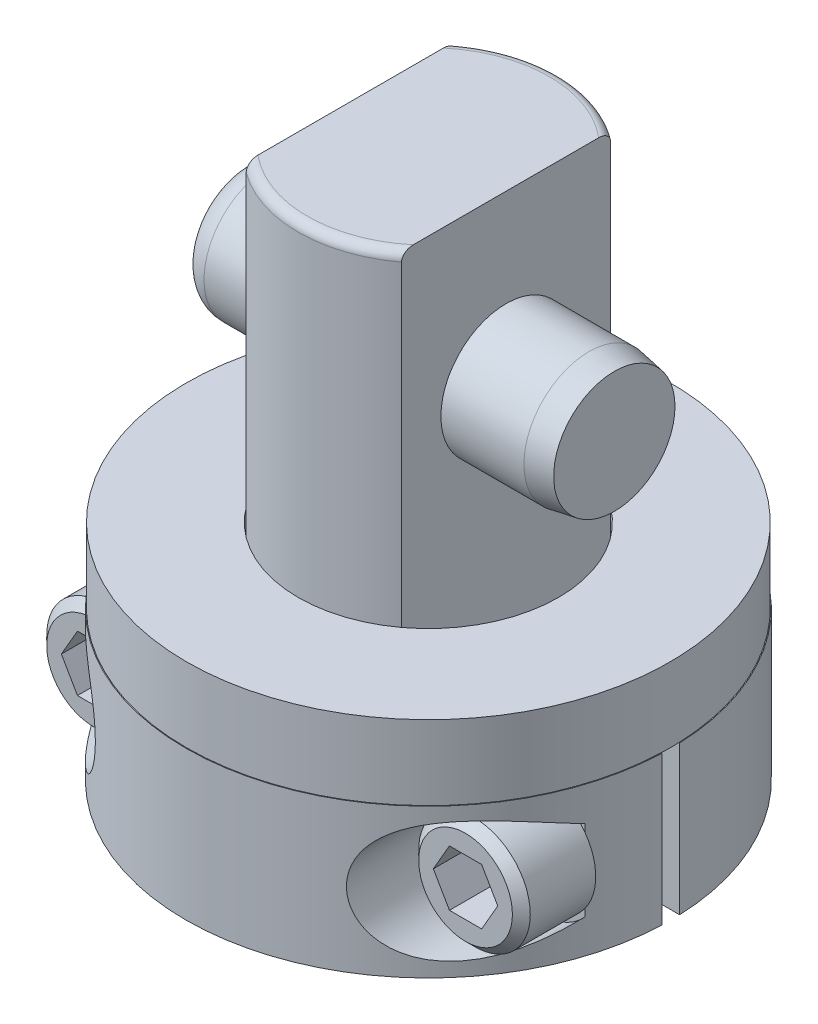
ISO-10303-21;
HEADER;
FILE_DESCRIPTION(('STEP AP214'),'2;1');
FILE_NAME('part.step','',(''),(''),'','','');
FILE_SCHEMA(('AUTOMOTIVE_DESIGN { 1 0 10303 214 1 1 1 1 }'));
ENDSEC;
DATA;
#1=APPLICATION_CONTEXT('core data for automotive mechanical design processes');
#2=APPLICATION_PROTOCOL_DEFINITION('international standard','automotive_design',2000,#1);
#3=PRODUCT_CONTEXT('',#1,'mechanical');
#4=PRODUCT('Part','Part','',(#3));
#5=PRODUCT_RELATED_PRODUCT_CATEGORY('part','',(#4));
#6=PRODUCT_DEFINITION_FORMATION('','',#4);
#7=PRODUCT_DEFINITION_CONTEXT('part definition',#1,'design');
#8=PRODUCT_DEFINITION('design','',#6,#7);
#9=PRODUCT_DEFINITION_SHAPE('','',#8);
#10=(LENGTH_UNIT() NAMED_UNIT(*) SI_UNIT(.MILLI.,.METRE.));
#11=(NAMED_UNIT(*) PLANE_ANGLE_UNIT() SI_UNIT($,.RADIAN.));
#12=(NAMED_UNIT(*) SI_UNIT($,.STERADIAN.) SOLID_ANGLE_UNIT());
#13=UNCERTAINTY_MEASURE_WITH_UNIT(LENGTH_MEASURE(1.E-05),#10,'distance_accuracy_value','');
#14=(GEOMETRIC_REPRESENTATION_CONTEXT(3) GLOBAL_UNCERTAINTY_ASSIGNED_CONTEXT((#13)) GLOBAL_UNIT_ASSIGNED_CONTEXT((#10,
#11,#12)) REPRESENTATION_CONTEXT('',''));
#15=CARTESIAN_POINT('',(0.,0.,0.));
#16=DIRECTION('',(0.,0.,1.));
#17=DIRECTION('',(1.,0.,0.));
#18=AXIS2_PLACEMENT_3D('',#15,#16,#17);
#19=CARTESIAN_POINT('',(0.,-15.35938,0.));
#20=DIRECTION('',(0.,-1.,0.));
#21=DIRECTION('',(0.,0.,-1.));
#22=AXIS2_PLACEMENT_3D('',#19,#20,#21);
#23=CYLINDRICAL_SURFACE('',#22,11.1125);
#24=DIRECTION('',(0.,1.,0.));
#25=VECTOR('',#24,1.);
#26=CARTESIAN_POINT('',(-11.0863435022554,-6.35,0.761999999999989));
#27=LINE('',#26,#25);
#28=CARTESIAN_POINT('',(-11.0863435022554,0.,0.761999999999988));
#29=VERTEX_POINT('',#28);
#30=CARTESIAN_POINT('',(-11.0863435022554,6.35,0.761999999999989));
#31=VERTEX_POINT('',#30);
#32=EDGE_CURVE('E471',#29,#31,#27,.T.);
#33=ORIENTED_EDGE('',*,*,#32,.T.);
#34=CARTESIAN_POINT('',(0.,6.35,0.));
#35=DIRECTION('',(0.,1.,0.));
#36=DIRECTION('',(0.,0.,1.));
#37=AXIS2_PLACEMENT_3D('',#34,#35,#36);
#38=CIRCLE('',#37,11.1125);
#39=CARTESIAN_POINT('',(-11.0863435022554,6.35,-0.762000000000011));
#40=VERTEX_POINT('',#39);
#41=EDGE_CURVE('E618',#40,#31,#38,.T.);
#42=ORIENTED_EDGE('',*,*,#41,.F.);
#43=DIRECTION('',(0.,1.,0.));
#44=VECTOR('',#43,1.);
#45=CARTESIAN_POINT('',(-11.0863435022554,-6.35,-0.762000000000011));
#46=LINE('',#45,#44);
#47=CARTESIAN_POINT('',(-11.0863435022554,0.,-0.762000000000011));
#48=VERTEX_POINT('',#47);
#49=EDGE_CURVE('E444',#48,#40,#46,.T.);
#50=ORIENTED_EDGE('',*,*,#49,.F.);
#51=CARTESIAN_POINT('',(0.,0.,0.));
#52=DIRECTION('',(0.,-1.,0.));
#53=DIRECTION('',(0.,0.,-1.));
#54=AXIS2_PLACEMENT_3D('',#51,#52,#53);
#55=CIRCLE('',#54,11.1125);
#56=EDGE_CURVE('E323',#29,#48,#55,.T.);
#57=ORIENTED_EDGE('',*,*,#56,.F.);
#58=EDGE_LOOP('',(#33,#42,#50,#57));
#59=FACE_BOUND('',#58,.T.);
#60=ADVANCED_FACE('F35',(#59),#23,.T.);
#61=DIRECTION('',(0.,1.,0.));
#62=VECTOR('',#61,1.);
#63=CARTESIAN_POINT('',(11.0863435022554,-6.35,-0.762000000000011));
#64=LINE('',#63,#62);
#65=CARTESIAN_POINT('',(11.0863435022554,0.,-0.762000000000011));
#66=VERTEX_POINT('',#65);
#67=CARTESIAN_POINT('',(11.0863435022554,6.35,-0.762000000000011));
#68=VERTEX_POINT('',#67);
#69=EDGE_CURVE('E439',#66,#68,#64,.T.);
#70=ORIENTED_EDGE('',*,*,#69,.T.);
#71=CARTESIAN_POINT('',(11.0863435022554,6.35,0.761999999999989));
#72=VERTEX_POINT('',#71);
#73=EDGE_CURVE('E301',#72,#68,#38,.T.);
#74=ORIENTED_EDGE('',*,*,#73,.F.);
#75=DIRECTION('',(0.,1.,0.));
#76=VECTOR('',#75,1.);
#77=CARTESIAN_POINT('',(11.0863435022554,-6.35,0.761999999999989));
#78=LINE('',#77,#76);
#79=CARTESIAN_POINT('',(11.0863435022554,0.,0.761999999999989));
#80=VERTEX_POINT('',#79);
#81=EDGE_CURVE('E476',#80,#72,#78,.T.);
#82=ORIENTED_EDGE('',*,*,#81,.F.);
#83=EDGE_CURVE('E318',#66,#80,#55,.T.);
#84=ORIENTED_EDGE('',*,*,#83,.F.);
#85=EDGE_LOOP('',(#70,#74,#82,#84));
#86=FACE_BOUND('',#85,.T.);
#87=ADVANCED_FACE('F370',(#86),#23,.T.);
#88=CARTESIAN_POINT('',(0.,6.35,0.));
#89=DIRECTION('',(0.,1.,0.));
#90=DIRECTION('',(0.,0.,1.));
#91=AXIS2_PLACEMENT_3D('',#88,#89,#90);
#92=PLANE('',#91);
#93=DIRECTION('',(1.,0.,0.));
#94=VECTOR('',#93,1.);
#95=CARTESIAN_POINT('',(-11.0863435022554,6.35,-0.762000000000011));
#96=LINE('',#95,#94);
#97=CARTESIAN_POINT('',(-20.6869707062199,6.35,-0.76200000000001));
#98=VERTEX_POINT('',#97);
#99=CARTESIAN_POINT('',(-20.6234275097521,6.35,-0.762000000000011));
#100=VERTEX_POINT('',#99);
#101=EDGE_CURVE('E459',#98,#100,#96,.T.);
#102=ORIENTED_EDGE('',*,*,#101,.T.);
#103=CARTESIAN_POINT('',(0.,6.35,0.));
#104=DIRECTION('',(0.,1.,0.));
#105=DIRECTION('',(0.,0.,1.));
#106=AXIS2_PLACEMENT_3D('',#103,#104,#105);
#107=CIRCLE('',#106,20.6375);
#108=CARTESIAN_POINT('',(20.6234275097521,6.35,-0.762000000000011));
#109=VERTEX_POINT('',#108);
#110=EDGE_CURVE('E615',#109,#100,#107,.T.);
#111=ORIENTED_EDGE('',*,*,#110,.F.);
#112=DIRECTION('',(1.,0.,0.));
#113=VECTOR('',#112,1.);
#114=CARTESIAN_POINT('',(11.0863435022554,6.35,-0.762000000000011));
#115=LINE('',#114,#113);
#116=CARTESIAN_POINT('',(20.6869707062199,6.35,-0.762000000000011));
#117=VERTEX_POINT('',#116);
#118=EDGE_CURVE('E467',#109,#117,#115,.T.);
#119=ORIENTED_EDGE('',*,*,#118,.T.);
#120=CARTESIAN_POINT('',(0.,6.35,0.));
#121=DIRECTION('',(0.,1.,0.));
#122=DIRECTION('',(0.,0.,1.));
#123=AXIS2_PLACEMENT_3D('',#120,#121,#122);
#124=CIRCLE('',#123,20.701);
#125=EDGE_CURVE('E462',#117,#98,#124,.T.);
#126=ORIENTED_EDGE('',*,*,#125,.T.);
#127=EDGE_LOOP('',(#102,#111,#119,#126));
#128=FACE_BOUND('',#127,.T.);
#129=ADVANCED_FACE('F390',(#128),#92,.T.);
#130=CARTESIAN_POINT('',(0.,6.35,0.));
#131=DIRECTION('',(0.,1.,0.));
#132=DIRECTION('',(0.,0.,1.));
#133=AXIS2_PLACEMENT_3D('',#130,#131,#132);
#134=PLANE('',#133);
#135=DIRECTION('',(-1.,0.,0.));
#136=VECTOR('',#135,1.);
#137=CARTESIAN_POINT('',(11.0863435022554,6.35,0.761999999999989));
#138=LINE('',#137,#136);
#139=CARTESIAN_POINT('',(20.6869707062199,6.35,0.761999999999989));
#140=VERTEX_POINT('',#139);
#141=CARTESIAN_POINT('',(20.6234275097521,6.35,0.761999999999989));
#142=VERTEX_POINT('',#141);
#143=EDGE_CURVE('E492',#140,#142,#138,.T.);
#144=ORIENTED_EDGE('',*,*,#143,.T.);
#145=CARTESIAN_POINT('',(0.,6.35,0.));
#146=DIRECTION('',(0.,1.,0.));
#147=DIRECTION('',(0.,0.,1.));
#148=AXIS2_PLACEMENT_3D('',#145,#146,#147);
#149=CIRCLE('',#148,20.6375);
#150=CARTESIAN_POINT('',(-20.6234275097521,6.35,0.761999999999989));
#151=VERTEX_POINT('',#150);
#152=EDGE_CURVE('E11',#142,#151,#149,.F.);
#153=ORIENTED_EDGE('',*,*,#152,.T.);
#154=DIRECTION('',(-1.,0.,0.));
#155=VECTOR('',#154,1.);
#156=CARTESIAN_POINT('',(-11.0863435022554,6.35,0.761999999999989));
#157=LINE('',#156,#155);
#158=CARTESIAN_POINT('',(-20.6869707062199,6.35,0.761999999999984));
#159=VERTEX_POINT('',#158);
#160=EDGE_CURVE('E501',#151,#159,#157,.T.);
#161=ORIENTED_EDGE('',*,*,#160,.T.);
#162=CARTESIAN_POINT('',(0.,6.35,0.));
#163=DIRECTION('',(0.,1.,0.));
#164=DIRECTION('',(0.,0.,1.));
#165=AXIS2_PLACEMENT_3D('',#162,#163,#164);
#166=CIRCLE('',#165,20.701);
#167=EDGE_CURVE('E496',#159,#140,#166,.T.);
#168=ORIENTED_EDGE('',*,*,#167,.T.);
#169=EDGE_LOOP('',(#144,#153,#161,#168));
#170=FACE_BOUND('',#169,.T.);
#171=ADVANCED_FACE('F659',(#170),#134,.T.);
#172=CARTESIAN_POINT('',(-15.875,0.,6.34999999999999));
#173=DIRECTION('',(0.,0.,1.));
#174=DIRECTION('',(1.,0.,0.));
#175=AXIS2_PLACEMENT_3D('',#172,#173,#174);
#176=PLANE('',#175);
#177=DIRECTION('',(0.,1.,0.));
#178=VECTOR('',#177,1.);
#179=CARTESIAN_POINT('',(-19.7030175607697,-6.35,6.34999999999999));
#180=LINE('',#179,#178);
#181=CARTESIAN_POINT('',(-19.7030175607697,2.83331745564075,6.34999999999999));
#182=VERTEX_POINT('',#181);
#183=CARTESIAN_POINT('',(-19.7030175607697,3.45437114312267,6.34999999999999));
#184=VERTEX_POINT('',#183);
#185=EDGE_CURVE('E757',#182,#184,#180,.T.);
#186=ORIENTED_EDGE('',*,*,#185,.F.);
#187=CARTESIAN_POINT('',(-15.875,0.,6.34999999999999));
#188=DIRECTION('',(0.,0.,1.));
#189=DIRECTION('',(1.,0.,0.));
#190=AXIS2_PLACEMENT_3D('',#187,#188,#189);
#191=CIRCLE('',#190,4.7625);
#192=CARTESIAN_POINT('',(-19.7030175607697,-2.83331745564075,6.34999999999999));
#193=VERTEX_POINT('',#192);
#194=EDGE_CURVE('E909',#182,#193,#191,.F.);
#195=ORIENTED_EDGE('',*,*,#194,.T.);
#196=CARTESIAN_POINT('',(-19.7030175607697,-3.45437114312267,6.34999999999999));
#197=VERTEX_POINT('',#196);
#198=EDGE_CURVE('E758',#197,#193,#180,.T.);
#199=ORIENTED_EDGE('',*,*,#198,.F.);
#200=CARTESIAN_POINT('',(-15.875,0.,6.34999999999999));
#201=DIRECTION('',(0.,0.,1.));
#202=DIRECTION('',(1.,0.,0.));
#203=AXIS2_PLACEMENT_3D('',#200,#201,#202);
#204=CIRCLE('',#203,5.1562);
#205=EDGE_CURVE('E505',#197,#184,#204,.T.);
#206=ORIENTED_EDGE('',*,*,#205,.T.);
#207=EDGE_LOOP('',(#186,#195,#199,#206));
#208=FACE_BOUND('',#207,.T.);
#209=ADVANCED_FACE('F774',(#208),#176,.T.);
#210=CARTESIAN_POINT('',(15.875,0.,6.34999999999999));
#211=DIRECTION('',(0.,0.,1.));
#212=DIRECTION('',(1.,0.,0.));
#213=AXIS2_PLACEMENT_3D('',#210,#211,#212);
#214=PLANE('',#213);
#215=DIRECTION('',(0.,1.,0.));
#216=VECTOR('',#215,1.);
#217=CARTESIAN_POINT('',(19.7030175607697,-6.35,6.34999999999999));
#218=LINE('',#217,#216);
#219=CARTESIAN_POINT('',(19.7030175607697,-2.83331745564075,6.34999999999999));
#220=VERTEX_POINT('',#219);
#221=CARTESIAN_POINT('',(19.7030175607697,-3.45437114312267,6.34999999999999));
#222=VERTEX_POINT('',#221);
#223=EDGE_CURVE('E744',#220,#222,#218,.F.);
#224=ORIENTED_EDGE('',*,*,#223,.F.);
#225=CARTESIAN_POINT('',(15.875,0.,6.34999999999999));
#226=DIRECTION('',(0.,0.,1.));
#227=DIRECTION('',(1.,0.,0.));
#228=AXIS2_PLACEMENT_3D('',#225,#226,#227);
#229=CIRCLE('',#228,4.7625);
#230=CARTESIAN_POINT('',(19.7030175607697,2.83331745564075,6.34999999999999));
#231=VERTEX_POINT('',#230);
#232=EDGE_CURVE('E508',#231,#220,#229,.T.);
#233=ORIENTED_EDGE('',*,*,#232,.F.);
#234=CARTESIAN_POINT('',(19.7030175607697,3.45437114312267,6.34999999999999));
#235=VERTEX_POINT('',#234);
#236=EDGE_CURVE('E745',#235,#231,#218,.F.);
#237=ORIENTED_EDGE('',*,*,#236,.F.);
#238=CARTESIAN_POINT('',(15.875,0.,6.34999999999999));
#239=DIRECTION('',(0.,0.,1.));
#240=DIRECTION('',(1.,0.,0.));
#241=AXIS2_PLACEMENT_3D('',#238,#239,#240);
#242=CIRCLE('',#241,5.1562);
#243=EDGE_CURVE('E502',#235,#222,#242,.T.);
#244=ORIENTED_EDGE('',*,*,#243,.T.);
#245=EDGE_LOOP('',(#224,#233,#237,#244));
#246=FACE_BOUND('',#245,.T.);
#247=ADVANCED_FACE('F770',(#246),#214,.T.);
#248=CARTESIAN_POINT('',(0.,-6.35,0.));
#249=DIRECTION('',(0.,1.,0.));
#250=DIRECTION('',(0.,0.,1.));
#251=AXIS2_PLACEMENT_3D('',#248,#249,#250);
#252=CYLINDRICAL_SURFACE('',#251,20.701);
#253=ORIENTED_EDGE('',*,*,#236,.T.);
#254=EDGE_CURVE('E749',#231,#220,#218,.F.);
#255=ORIENTED_EDGE('',*,*,#254,.T.);
#256=ORIENTED_EDGE('',*,*,#223,.T.);
#257=CARTESIAN_POINT('',(19.7030175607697,-3.45437114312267,6.34999999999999));
#258=CARTESIAN_POINT('',(19.6263938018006,-3.53929541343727,6.58772883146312));
#259=CARTESIAN_POINT('',(19.5453947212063,-3.62336207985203,6.82434175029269));
#260=CARTESIAN_POINT('',(19.3745027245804,-3.78866627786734,7.29540282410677));
#261=CARTESIAN_POINT('',(19.2846076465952,-3.86990311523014,7.52985043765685));
#262=CARTESIAN_POINT('',(19.0006520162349,-4.10828228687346,8.23177807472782));
#263=CARTESIAN_POINT('',(18.7929444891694,-4.25938108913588,8.69590159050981));
#264=CARTESIAN_POINT('',(18.3370666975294,-4.53840784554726,9.62042777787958));
#265=CARTESIAN_POINT('',(18.0883508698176,-4.66596603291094,10.0806776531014));
#266=CARTESIAN_POINT('',(17.6867006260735,-4.82959178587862,10.7601648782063));
#267=CARTESIAN_POINT('',(17.5481752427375,-4.87948658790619,10.9846728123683));
#268=CARTESIAN_POINT('',(17.2616205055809,-4.96852050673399,11.4296914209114));
#269=CARTESIAN_POINT('',(17.1135935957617,-5.00766237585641,11.6502031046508));
#270=CARTESIAN_POINT('',(16.820246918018,-5.0708586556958,12.0694198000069));
#271=CARTESIAN_POINT('',(16.6756320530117,-5.09585850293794,12.268474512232));
#272=CARTESIAN_POINT('',(16.3787776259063,-5.13371182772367,12.66206107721));
#273=CARTESIAN_POINT('',(16.2265375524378,-5.14656448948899,12.8565926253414));
#274=CARTESIAN_POINT('',(15.9154563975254,-5.15838261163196,13.2397256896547));
#275=CARTESIAN_POINT('',(15.7566384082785,-5.15739312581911,13.4283444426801));
#276=CARTESIAN_POINT('',(15.4327291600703,-5.13975623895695,13.7993795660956));
#277=CARTESIAN_POINT('',(15.2676389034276,-5.1231113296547,13.9817969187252));
#278=CARTESIAN_POINT('',(14.9567422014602,-5.07584404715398,14.3133202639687));
#279=CARTESIAN_POINT('',(14.8116252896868,-5.04760798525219,14.4634110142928));
#280=CARTESIAN_POINT('',(14.5186786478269,-4.97689523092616,14.7574526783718));
#281=CARTESIAN_POINT('',(14.3708495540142,-4.93442183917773,14.9014050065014));
#282=CARTESIAN_POINT('',(14.0738727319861,-4.83393180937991,15.1822014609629));
#283=CARTESIAN_POINT('',(13.9247258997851,-4.77592504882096,15.3190500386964));
#284=CARTESIAN_POINT('',(13.6267485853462,-4.64309704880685,15.5847014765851));
#285=CARTESIAN_POINT('',(13.4779180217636,-4.56828084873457,15.713506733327));
#286=CARTESIAN_POINT('',(13.2186850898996,-4.42118412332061,15.9317009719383));
#287=CARTESIAN_POINT('',(13.1077538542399,-4.35272606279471,16.02304799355));
#288=CARTESIAN_POINT('',(12.8883944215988,-4.20524005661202,16.2000163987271));
#289=CARTESIAN_POINT('',(12.7799656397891,-4.1262146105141,16.285639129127));
#290=CARTESIAN_POINT('',(12.5667991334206,-3.95735962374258,16.45068808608));
#291=CARTESIAN_POINT('',(12.4620620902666,-3.86752810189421,16.5301131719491));
#292=CARTESIAN_POINT('',(12.2576984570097,-3.6770942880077,16.6822195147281));
#293=CARTESIAN_POINT('',(12.158069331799,-3.5764974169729,16.7549041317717));
#294=CARTESIAN_POINT('',(11.9644377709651,-3.36374374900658,16.8937252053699));
#295=CARTESIAN_POINT('',(11.8704936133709,-3.25149162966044,16.9597972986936));
#296=CARTESIAN_POINT('',(11.6907751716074,-3.01670387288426,17.084177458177));
#297=CARTESIAN_POINT('',(11.6049968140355,-2.89417342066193,17.1424894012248));
#298=CARTESIAN_POINT('',(11.4430811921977,-2.63955474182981,17.2509940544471));
#299=CARTESIAN_POINT('',(11.3669414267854,-2.50746900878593,17.3011888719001));
#300=CARTESIAN_POINT('',(11.2257092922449,-2.23474017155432,17.3931584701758));
#301=CARTESIAN_POINT('',(11.160615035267,-2.09409853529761,17.4349346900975));
#302=CARTESIAN_POINT('',(11.05077333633,-1.82520360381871,17.5047264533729));
#303=CARTESIAN_POINT('',(11.0044622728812,-1.69787111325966,17.5338411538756));
#304=CARTESIAN_POINT('',(10.9217276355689,-1.43874315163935,17.5854954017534));
#305=CARTESIAN_POINT('',(10.8853028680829,-1.306948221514,17.6080357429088));
#306=CARTESIAN_POINT('',(10.8229158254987,-1.0400119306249,17.6464511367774));
#307=CARTESIAN_POINT('',(10.7969492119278,-0.904871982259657,17.6623289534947));
#308=CARTESIAN_POINT('',(10.7558662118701,-0.63233993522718,17.6873775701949));
#309=CARTESIAN_POINT('',(10.7407492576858,-0.494947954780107,17.6965487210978));
#310=CARTESIAN_POINT('',(10.7224320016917,-0.231066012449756,17.7076523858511));
#311=CARTESIAN_POINT('',(10.7183132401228,-0.104662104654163,17.7101428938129));
#312=CARTESIAN_POINT('',(10.7193783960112,0.148135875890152,17.7094982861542));
#313=CARTESIAN_POINT('',(10.7245652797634,0.274529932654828,17.7063613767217));
#314=CARTESIAN_POINT('',(10.7441733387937,0.526256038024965,17.6944700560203));
#315=CARTESIAN_POINT('',(10.7585890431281,0.651588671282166,17.6857189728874));
#316=CARTESIAN_POINT('',(10.7964655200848,0.900404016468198,17.6626222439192));
#317=CARTESIAN_POINT('',(10.81992963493,1.02388602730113,17.6482745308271));
#318=CARTESIAN_POINT('',(10.8751359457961,1.26606850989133,17.6143081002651));
#319=CARTESIAN_POINT('',(10.9067357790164,1.38481421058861,17.5947798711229));
#320=CARTESIAN_POINT('',(10.9780024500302,1.61888416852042,17.550402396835));
#321=CARTESIAN_POINT('',(11.0176721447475,1.73420719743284,17.5255512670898));
#322=CARTESIAN_POINT('',(11.1045681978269,1.96063214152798,17.4706211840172));
#323=CARTESIAN_POINT('',(11.1517918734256,2.07173553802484,17.440544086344));
#324=CARTESIAN_POINT('',(11.2532569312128,2.28916814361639,17.3752481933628));
#325=CARTESIAN_POINT('',(11.3075009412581,2.39549554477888,17.3400274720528));
#326=CARTESIAN_POINT('',(11.4244959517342,2.60662725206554,17.2631794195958));
#327=CARTESIAN_POINT('',(11.4874873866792,2.71122977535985,17.2213633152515));
#328=CARTESIAN_POINT('',(11.6195833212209,2.91419172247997,17.1325140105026));
#329=CARTESIAN_POINT('',(11.6886900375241,3.0125488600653,17.0854789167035));
#330=CARTESIAN_POINT('',(11.9039926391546,3.29758706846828,16.9368434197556));
#331=CARTESIAN_POINT('',(12.0582544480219,3.47438299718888,16.8276588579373));
#332=CARTESIAN_POINT('',(12.3975021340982,3.81534441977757,16.5795551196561));
#333=CARTESIAN_POINT('',(12.5840171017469,3.97660172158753,16.4387754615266));
#334=CARTESIAN_POINT('',(12.9675730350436,4.26507947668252,16.1379316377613));
#335=CARTESIAN_POINT('',(13.1646207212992,4.39227787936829,15.9778550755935));
#336=CARTESIAN_POINT('',(13.5120061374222,4.5860186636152,15.6842274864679));
#337=CARTESIAN_POINT('',(13.6614780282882,4.65976003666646,15.5542843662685));
#338=CARTESIAN_POINT('',(13.9606407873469,4.79043523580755,15.2863407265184));
#339=CARTESIAN_POINT('',(14.1103317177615,4.84736256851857,15.1483371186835));
#340=CARTESIAN_POINT('',(14.4083106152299,4.94569218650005,14.8652038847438));
#341=CARTESIAN_POINT('',(14.5565969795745,4.98707843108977,14.7200670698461));
#342=CARTESIAN_POINT('',(14.8503442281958,5.0556139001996,14.423670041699));
#343=CARTESIAN_POINT('',(14.9958042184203,5.08275868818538,14.2724079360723));
#344=CARTESIAN_POINT('',(15.3467186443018,5.1333447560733,13.8961135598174));
#345=CARTESIAN_POINT('',(15.5500923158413,5.14977323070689,13.6681841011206));
#346=CARTESIAN_POINT('',(15.9467701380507,5.15951943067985,13.2032367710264));
#347=CARTESIAN_POINT('',(16.1400694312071,5.15282611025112,12.9662146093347));
#348=CARTESIAN_POINT('',(16.5162092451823,5.11967375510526,12.4836001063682));
#349=CARTESIAN_POINT('',(16.6989957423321,5.09312101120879,12.2379724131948));
#350=CARTESIAN_POINT('',(17.0524602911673,5.02319094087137,11.7404516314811));
#351=CARTESIAN_POINT('',(17.2231344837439,4.97980828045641,11.4885565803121));
#352=CARTESIAN_POINT('',(17.6405771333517,4.85172289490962,10.8424481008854));
#353=CARTESIAN_POINT('',(17.8788377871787,4.75734911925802,10.4446318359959));
#354=CARTESIAN_POINT('',(18.3257775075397,4.54329582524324,9.63897929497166));
#355=CARTESIAN_POINT('',(18.5344237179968,4.4235885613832,9.23113246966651));
#356=CARTESIAN_POINT('',(18.9190010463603,4.16806770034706,8.41445164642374));
#357=CARTESIAN_POINT('',(19.095431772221,4.03256546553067,8.0057544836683));
#358=CARTESIAN_POINT('',(19.3389923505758,3.82082334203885,7.38807266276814));
#359=CARTESIAN_POINT('',(19.4165878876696,3.74891528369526,7.18164579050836));
#360=CARTESIAN_POINT('',(19.5649211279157,3.60301447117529,6.76710178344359));
#361=CARTESIAN_POINT('',(19.635659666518,3.52902197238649,6.55898485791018));
#362=CARTESIAN_POINT('',(19.7030175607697,3.45437114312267,6.34999999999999));
#363=B_SPLINE_CURVE_WITH_KNOTS('',3,(#257,#258,#259,#260,#261,#262,#263,#264,#265,#266,#267,
#268,#269,#270,#271,#272,#273,#274,#275,#276,#277,#278,#279,#280,#281,#282,#283,#284,#285,#286,
#287,#288,#289,#290,#291,#292,#293,#294,#295,#296,#297,#298,#299,#300,#301,#302,#303,#304,#305,
#306,#307,#308,#309,#310,#311,#312,#313,#314,#315,#316,#317,#318,#319,#320,#321,#322,#323,#324,
#325,#326,#327,#328,#329,#330,#331,#332,#333,#334,#335,#336,#337,#338,#339,#340,#341,#342,#343,
#344,#345,#346,#347,#348,#349,#350,#351,#352,#353,#354,#355,#356,#357,#358,#359,#360,#361,#362),
.UNSPECIFIED.,.F.,.F.,(4,2,2,2,2,2,2,2,2,2,2,2,2,2,2,2,2,2,2,2,2,2,2,2,2,2,2,2,2,2,2,2,2,2,2,2,
2,2,2,2,2,2,2,2,2,2,2,2,2,2,2,2,4),(0.,0.791375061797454,1.58294292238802,3.17254131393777,
4.78530543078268,5.59041542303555,6.3953191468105,7.13683310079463,7.87839684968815,
8.61754749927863,9.35658052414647,9.98807586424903,10.6194249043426,11.2503734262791,
11.8811330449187,12.3582305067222,12.8352153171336,13.3122877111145,13.7891209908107,
14.2702179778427,14.7510737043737,15.2318043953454,15.7124528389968,16.1276530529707,
16.5428031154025,16.9577807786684,17.3727367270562,17.7517642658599,18.1309126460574,
18.5098364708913,18.8889003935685,19.2617354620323,19.6347027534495,20.007537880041,
20.3805129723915,20.7672828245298,21.1541934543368,21.9274855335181,22.7761088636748,
23.6252802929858,24.2584851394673,24.8919342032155,25.5260352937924,26.1603338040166,
27.0766536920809,27.9934113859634,28.9145224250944,29.8359256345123,31.2534367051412,
32.672508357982,34.0672478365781,34.7630211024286,35.458709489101),.UNSPECIFIED.);
#364=EDGE_CURVE('E748',#222,#235,#363,.T.);
#365=ORIENTED_EDGE('',*,*,#364,.T.);
#366=EDGE_LOOP('',(#253,#255,#256,#365));
#367=FACE_BOUND('',#366,.T.);
#368=DIRECTION('',(0.,1.,0.));
#369=VECTOR('',#368,1.);
#370=CARTESIAN_POINT('',(20.6869707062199,-6.35,0.761999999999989));
#371=LINE('',#370,#369);
#372=CARTESIAN_POINT('',(20.6869707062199,-6.35,0.761999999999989));
#373=VERTEX_POINT('',#372);
#374=EDGE_CURVE('E474',#373,#140,#371,.T.);
#375=ORIENTED_EDGE('',*,*,#374,.T.);
#376=ORIENTED_EDGE('',*,*,#167,.F.);
#377=DIRECTION('',(0.,1.,0.));
#378=VECTOR('',#377,1.);
#379=CARTESIAN_POINT('',(-20.6869707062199,-6.35,0.761999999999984));
#380=LINE('',#379,#378);
#381=CARTESIAN_POINT('',(-20.6869707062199,-6.35,0.761999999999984));
#382=VERTEX_POINT('',#381);
#383=EDGE_CURVE('E470',#382,#159,#380,.T.);
#384=ORIENTED_EDGE('',*,*,#383,.F.);
#385=CARTESIAN_POINT('',(0.,-6.35,0.));
#386=DIRECTION('',(0.,1.,0.));
#387=DIRECTION('',(0.,0.,1.));
#388=AXIS2_PLACEMENT_3D('',#385,#386,#387);
#389=CIRCLE('',#388,20.701);
#390=EDGE_CURVE('E483',#382,#373,#389,.T.);
#391=ORIENTED_EDGE('',*,*,#390,.T.);
#392=EDGE_LOOP('',(#375,#376,#384,#391));
#393=FACE_BOUND('',#392,.T.);
#394=ORIENTED_EDGE('',*,*,#198,.T.);
#395=EDGE_CURVE('E1471',#193,#182,#180,.T.);
#396=ORIENTED_EDGE('',*,*,#395,.T.);
#397=ORIENTED_EDGE('',*,*,#185,.T.);
#398=CARTESIAN_POINT('',(-19.7030175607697,3.45437114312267,6.34999999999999));
#399=CARTESIAN_POINT('',(-19.6263938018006,3.53929541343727,6.58772883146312));
#400=CARTESIAN_POINT('',(-19.5453947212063,3.62336207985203,6.82434175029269));
#401=CARTESIAN_POINT('',(-19.3745027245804,3.78866627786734,7.29540282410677));
#402=CARTESIAN_POINT('',(-19.2846076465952,3.86990311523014,7.52985043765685));
#403=CARTESIAN_POINT('',(-19.0006520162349,4.10828228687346,8.23177807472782));
#404=CARTESIAN_POINT('',(-18.7929444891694,4.25938108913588,8.69590159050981));
#405=CARTESIAN_POINT('',(-18.3370666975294,4.53840784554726,9.62042777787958));
#406=CARTESIAN_POINT('',(-18.0883508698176,4.66596603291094,10.0806776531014));
#407=CARTESIAN_POINT('',(-17.6867006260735,4.82959178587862,10.7601648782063));
#408=CARTESIAN_POINT('',(-17.5481752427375,4.87948658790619,10.9846728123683));
#409=CARTESIAN_POINT('',(-17.2616205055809,4.96852050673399,11.4296914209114));
#410=CARTESIAN_POINT('',(-17.1135935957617,5.00766237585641,11.6502031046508));
#411=CARTESIAN_POINT('',(-16.820246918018,5.0708586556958,12.0694198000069));
#412=CARTESIAN_POINT('',(-16.6756320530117,5.09585850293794,12.268474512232));
#413=CARTESIAN_POINT('',(-16.3787776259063,5.13371182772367,12.66206107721));
#414=CARTESIAN_POINT('',(-16.2265375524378,5.14656448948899,12.8565926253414));
#415=CARTESIAN_POINT('',(-15.9154563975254,5.15838261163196,13.2397256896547));
#416=CARTESIAN_POINT('',(-15.7566384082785,5.15739312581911,13.4283444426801));
#417=CARTESIAN_POINT('',(-15.4327291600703,5.13975623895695,13.7993795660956));
#418=CARTESIAN_POINT('',(-15.2676389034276,5.1231113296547,13.9817969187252));
#419=CARTESIAN_POINT('',(-14.9567422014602,5.07584404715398,14.3133202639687));
#420=CARTESIAN_POINT('',(-14.8116252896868,5.04760798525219,14.4634110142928));
#421=CARTESIAN_POINT('',(-14.5186786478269,4.97689523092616,14.7574526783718));
#422=CARTESIAN_POINT('',(-14.3708495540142,4.93442183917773,14.9014050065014));
#423=CARTESIAN_POINT('',(-14.0738727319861,4.83393180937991,15.1822014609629));
#424=CARTESIAN_POINT('',(-13.9247258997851,4.77592504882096,15.3190500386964));
#425=CARTESIAN_POINT('',(-13.6267485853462,4.64309704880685,15.5847014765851));
#426=CARTESIAN_POINT('',(-13.4779180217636,4.56828084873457,15.713506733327));
#427=CARTESIAN_POINT('',(-13.2186850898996,4.42118412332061,15.9317009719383));
#428=CARTESIAN_POINT('',(-13.1077538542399,4.35272606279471,16.02304799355));
#429=CARTESIAN_POINT('',(-12.8883944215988,4.20524005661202,16.2000163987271));
#430=CARTESIAN_POINT('',(-12.7799656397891,4.1262146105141,16.285639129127));
#431=CARTESIAN_POINT('',(-12.5667991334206,3.95735962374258,16.45068808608));
#432=CARTESIAN_POINT('',(-12.4620620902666,3.86752810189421,16.5301131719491));
#433=CARTESIAN_POINT('',(-12.2576984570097,3.6770942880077,16.6822195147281));
#434=CARTESIAN_POINT('',(-12.158069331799,3.5764974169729,16.7549041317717));
#435=CARTESIAN_POINT('',(-11.9644377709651,3.36374374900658,16.8937252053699));
#436=CARTESIAN_POINT('',(-11.8704936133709,3.25149162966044,16.9597972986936));
#437=CARTESIAN_POINT('',(-11.6907751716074,3.01670387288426,17.084177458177));
#438=CARTESIAN_POINT('',(-11.6049968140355,2.89417342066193,17.1424894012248));
#439=CARTESIAN_POINT('',(-11.4430811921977,2.63955474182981,17.2509940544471));
#440=CARTESIAN_POINT('',(-11.3669414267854,2.50746900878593,17.3011888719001));
#441=CARTESIAN_POINT('',(-11.2257092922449,2.23474017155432,17.3931584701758));
#442=CARTESIAN_POINT('',(-11.160615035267,2.09409853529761,17.4349346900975));
#443=CARTESIAN_POINT('',(-11.05077333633,1.82520360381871,17.5047264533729));
#444=CARTESIAN_POINT('',(-11.0044622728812,1.69787111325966,17.5338411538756));
#445=CARTESIAN_POINT('',(-10.9217276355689,1.43874315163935,17.5854954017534));
#446=CARTESIAN_POINT('',(-10.8853028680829,1.306948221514,17.6080357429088));
#447=CARTESIAN_POINT('',(-10.8229158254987,1.0400119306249,17.6464511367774));
#448=CARTESIAN_POINT('',(-10.7969492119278,0.904871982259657,17.6623289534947));
#449=CARTESIAN_POINT('',(-10.7558662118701,0.63233993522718,17.6873775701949));
#450=CARTESIAN_POINT('',(-10.7407492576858,0.494947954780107,17.6965487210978));
#451=CARTESIAN_POINT('',(-10.7224320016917,0.231066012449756,17.7076523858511));
#452=CARTESIAN_POINT('',(-10.7183132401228,0.104662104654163,17.7101428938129));
#453=CARTESIAN_POINT('',(-10.7193783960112,-0.148135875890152,17.7094982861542));
#454=CARTESIAN_POINT('',(-10.7245652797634,-0.274529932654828,17.7063613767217));
#455=CARTESIAN_POINT('',(-10.7441733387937,-0.526256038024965,17.6944700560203));
#456=CARTESIAN_POINT('',(-10.7585890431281,-0.651588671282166,17.6857189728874));
#457=CARTESIAN_POINT('',(-10.7964655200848,-0.900404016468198,17.6626222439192));
#458=CARTESIAN_POINT('',(-10.81992963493,-1.02388602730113,17.6482745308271));
#459=CARTESIAN_POINT('',(-10.8751359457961,-1.26606850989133,17.6143081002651));
#460=CARTESIAN_POINT('',(-10.9067357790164,-1.38481421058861,17.5947798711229));
#461=CARTESIAN_POINT('',(-10.9780024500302,-1.61888416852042,17.550402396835));
#462=CARTESIAN_POINT('',(-11.0176721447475,-1.73420719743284,17.5255512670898));
#463=CARTESIAN_POINT('',(-11.1045681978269,-1.96063214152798,17.4706211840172));
#464=CARTESIAN_POINT('',(-11.1517918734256,-2.07173553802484,17.440544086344));
#465=CARTESIAN_POINT('',(-11.2532569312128,-2.28916814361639,17.3752481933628));
#466=CARTESIAN_POINT('',(-11.3075009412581,-2.39549554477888,17.3400274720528));
#467=CARTESIAN_POINT('',(-11.4244959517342,-2.60662725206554,17.2631794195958));
#468=CARTESIAN_POINT('',(-11.4874873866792,-2.71122977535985,17.2213633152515));
#469=CARTESIAN_POINT('',(-11.6195833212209,-2.91419172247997,17.1325140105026));
#470=CARTESIAN_POINT('',(-11.6886900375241,-3.0125488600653,17.0854789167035));
#471=CARTESIAN_POINT('',(-11.9039926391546,-3.29758706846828,16.9368434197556));
#472=CARTESIAN_POINT('',(-12.0582544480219,-3.47438299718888,16.8276588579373));
#473=CARTESIAN_POINT('',(-12.3975021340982,-3.81534441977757,16.5795551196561));
#474=CARTESIAN_POINT('',(-12.5840171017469,-3.97660172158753,16.4387754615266));
#475=CARTESIAN_POINT('',(-12.9675730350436,-4.26507947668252,16.1379316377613));
#476=CARTESIAN_POINT('',(-13.1646207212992,-4.39227787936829,15.9778550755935));
#477=CARTESIAN_POINT('',(-13.5120061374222,-4.5860186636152,15.6842274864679));
#478=CARTESIAN_POINT('',(-13.6614780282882,-4.65976003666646,15.5542843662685));
#479=CARTESIAN_POINT('',(-13.9606407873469,-4.79043523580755,15.2863407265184));
#480=CARTESIAN_POINT('',(-14.1103317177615,-4.84736256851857,15.1483371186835));
#481=CARTESIAN_POINT('',(-14.4083106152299,-4.94569218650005,14.8652038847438));
#482=CARTESIAN_POINT('',(-14.5565969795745,-4.98707843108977,14.7200670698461));
#483=CARTESIAN_POINT('',(-14.8503442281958,-5.0556139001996,14.423670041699));
#484=CARTESIAN_POINT('',(-14.9958042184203,-5.08275868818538,14.2724079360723));
#485=CARTESIAN_POINT('',(-15.3467186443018,-5.1333447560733,13.8961135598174));
#486=CARTESIAN_POINT('',(-15.5500923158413,-5.14977323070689,13.6681841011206));
#487=CARTESIAN_POINT('',(-15.9467701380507,-5.15951943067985,13.2032367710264));
#488=CARTESIAN_POINT('',(-16.1400694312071,-5.15282611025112,12.9662146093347));
#489=CARTESIAN_POINT('',(-16.5162092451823,-5.11967375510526,12.4836001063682));
#490=CARTESIAN_POINT('',(-16.6989957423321,-5.09312101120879,12.2379724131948));
#491=CARTESIAN_POINT('',(-17.0524602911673,-5.02319094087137,11.7404516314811));
#492=CARTESIAN_POINT('',(-17.2231344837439,-4.97980828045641,11.4885565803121));
#493=CARTESIAN_POINT('',(-17.6405771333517,-4.85172289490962,10.8424481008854));
#494=CARTESIAN_POINT('',(-17.8788377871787,-4.75734911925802,10.4446318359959));
#495=CARTESIAN_POINT('',(-18.3257775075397,-4.54329582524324,9.63897929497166));
#496=CARTESIAN_POINT('',(-18.5344237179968,-4.4235885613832,9.23113246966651));
#497=CARTESIAN_POINT('',(-18.9190010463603,-4.16806770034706,8.41445164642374));
#498=CARTESIAN_POINT('',(-19.095431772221,-4.03256546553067,8.0057544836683));
#499=CARTESIAN_POINT('',(-19.3389923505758,-3.82082334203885,7.38807266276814));
#500=CARTESIAN_POINT('',(-19.4165878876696,-3.74891528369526,7.18164579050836));
#501=CARTESIAN_POINT('',(-19.5649211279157,-3.60301447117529,6.76710178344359));
#502=CARTESIAN_POINT('',(-19.635659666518,-3.52902197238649,6.55898485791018));
#503=CARTESIAN_POINT('',(-19.7030175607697,-3.45437114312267,6.34999999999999));
#504=B_SPLINE_CURVE_WITH_KNOTS('',3,(#398,#399,#400,#401,#402,#403,#404,#405,#406,#407,#408,
#409,#410,#411,#412,#413,#414,#415,#416,#417,#418,#419,#420,#421,#422,#423,#424,#425,#426,#427,
#428,#429,#430,#431,#432,#433,#434,#435,#436,#437,#438,#439,#440,#441,#442,#443,#444,#445,#446,
#447,#448,#449,#450,#451,#452,#453,#454,#455,#456,#457,#458,#459,#460,#461,#462,#463,#464,#465,
#466,#467,#468,#469,#470,#471,#472,#473,#474,#475,#476,#477,#478,#479,#480,#481,#482,#483,#484,
#485,#486,#487,#488,#489,#490,#491,#492,#493,#494,#495,#496,#497,#498,#499,#500,#501,#502,#503),
.UNSPECIFIED.,.F.,.F.,(4,2,2,2,2,2,2,2,2,2,2,2,2,2,2,2,2,2,2,2,2,2,2,2,2,2,2,2,2,2,2,2,2,2,2,2,
2,2,2,2,2,2,2,2,2,2,2,2,2,2,2,2,4),(0.,0.791375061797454,1.58294292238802,3.17254131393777,
4.78530543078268,5.59041542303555,6.3953191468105,7.13683310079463,7.87839684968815,
8.61754749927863,9.35658052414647,9.98807586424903,10.6194249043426,11.2503734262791,
11.8811330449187,12.3582305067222,12.8352153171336,13.3122877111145,13.7891209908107,
14.2702179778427,14.7510737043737,15.2318043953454,15.7124528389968,16.1276530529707,
16.5428031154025,16.9577807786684,17.3727367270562,17.7517642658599,18.1309126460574,
18.5098364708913,18.8889003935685,19.2617354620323,19.6347027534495,20.007537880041,
20.3805129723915,20.7672828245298,21.1541934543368,21.9274855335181,22.7761088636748,
23.6252802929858,24.2584851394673,24.8919342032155,25.5260352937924,26.1603338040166,
27.0766536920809,27.9934113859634,28.9145224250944,29.8359256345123,31.2534367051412,
32.672508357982,34.0672478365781,34.7630211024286,35.458709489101),.UNSPECIFIED.);
#505=EDGE_CURVE('E903',#184,#197,#504,.T.);
#506=ORIENTED_EDGE('',*,*,#505,.T.);
#507=EDGE_LOOP('',(#394,#396,#397,#506));
#508=FACE_BOUND('',#507,.T.);
#509=ADVANCED_FACE('F365',(#367,#393,#508),#252,.T.);
#510=CARTESIAN_POINT('',(0.,0.,-11.1125));
#511=DIRECTION('',(0.,-1.,0.));
#512=DIRECTION('',(0.,0.,-1.));
#513=AXIS2_PLACEMENT_3D('',#510,#511,#512);
#514=PLANE('',#513);
#515=ORIENTED_EDGE('',*,*,#83,.T.);
#516=EDGE_CURVE('E322',#80,#29,#55,.T.);
#517=ORIENTED_EDGE('',*,*,#516,.T.);
#518=ORIENTED_EDGE('',*,*,#56,.T.);
#519=EDGE_CURVE('E317',#48,#66,#55,.T.);
#520=ORIENTED_EDGE('',*,*,#519,.T.);
#521=EDGE_LOOP('',(#515,#517,#518,#520));
#522=FACE_BOUND('',#521,.T.);
#523=CARTESIAN_POINT('',(0.,0.,0.));
#524=DIRECTION('',(0.,-1.,0.));
#525=DIRECTION('',(0.,0.,-1.));
#526=AXIS2_PLACEMENT_3D('',#523,#524,#525);
#527=CIRCLE('',#526,5.588);
#528=CARTESIAN_POINT('',(0.,0.,-5.588));
#529=VERTEX_POINT('',#528);
#530=EDGE_CURVE('E425',#529,#529,#527,.T.);
#531=ORIENTED_EDGE('',*,*,#530,.F.);
#532=EDGE_LOOP('',(#531));
#533=FACE_BOUND('',#532,.T.);
#534=ADVANCED_FACE('F361',(#522,#533),#514,.T.);
#535=CARTESIAN_POINT('',(0.,-2.54,0.));
#536=DIRECTION('',(0.,-1.,0.));
#537=DIRECTION('',(0.,0.,-1.));
#538=AXIS2_PLACEMENT_3D('',#535,#536,#537);
#539=PLANE('',#538);
#540=CARTESIAN_POINT('',(0.,-2.54,0.));
#541=DIRECTION('',(0.,-1.,0.));
#542=DIRECTION('',(0.,0.,-1.));
#543=AXIS2_PLACEMENT_3D('',#540,#541,#542);
#544=CIRCLE('',#543,6.35);
#545=CARTESIAN_POINT('',(0.,-2.54,-6.35));
#546=VERTEX_POINT('',#545);
#547=EDGE_CURVE('E420',#546,#546,#544,.T.);
#548=ORIENTED_EDGE('',*,*,#547,.F.);
#549=EDGE_LOOP('',(#548));
#550=FACE_BOUND('',#549,.T.);
#551=CARTESIAN_POINT('',(0.,-2.54,0.));
#552=DIRECTION('',(0.,-1.,0.));
#553=DIRECTION('',(0.,0.,-1.));
#554=AXIS2_PLACEMENT_3D('',#551,#552,#553);
#555=CIRCLE('',#554,5.588);
#556=CARTESIAN_POINT('',(0.,-2.54,-5.588));
#557=VERTEX_POINT('',#556);
#558=EDGE_CURVE('E424',#557,#557,#555,.T.);
#559=ORIENTED_EDGE('',*,*,#558,.T.);
#560=EDGE_LOOP('',(#559));
#561=FACE_BOUND('',#560,.T.);
#562=ADVANCED_FACE('F364',(#550,#561),#539,.F.);
#563=CARTESIAN_POINT('',(0.,-2.54,0.));
#564=DIRECTION('',(0.,1.,0.));
#565=DIRECTION('',(0.,0.,1.));
#566=AXIS2_PLACEMENT_3D('',#563,#564,#565);
#567=CYLINDRICAL_SURFACE('',#566,5.588);
#568=ORIENTED_EDGE('',*,*,#558,.F.);
#569=EDGE_LOOP('',(#568));
#570=FACE_BOUND('',#569,.T.);
#571=ORIENTED_EDGE('',*,*,#530,.T.);
#572=EDGE_LOOP('',(#571));
#573=FACE_BOUND('',#572,.T.);
#574=ADVANCED_FACE('F355',(#570,#573),#567,.T.);
#575=CARTESIAN_POINT('',(0.,-12.7,-6.35));
#576=DIRECTION('',(0.,-1.,0.));
#577=DIRECTION('',(0.,0.,-1.));
#578=AXIS2_PLACEMENT_3D('',#575,#576,#577);
#579=PLANE('',#578);
#580=CARTESIAN_POINT('',(0.,-12.7,0.));
#581=DIRECTION('',(0.,-1.,0.));
#582=DIRECTION('',(0.,0.,-1.));
#583=AXIS2_PLACEMENT_3D('',#580,#581,#582);
#584=CIRCLE('',#583,5.588);
#585=CARTESIAN_POINT('',(0.,-12.7,5.588));
#586=VERTEX_POINT('',#585);
#587=EDGE_CURVE('E725',#586,#586,#584,.T.);
#588=ORIENTED_EDGE('',*,*,#587,.T.);
#589=EDGE_LOOP('',(#588));
#590=FACE_BOUND('',#589,.T.);
#591=ADVANCED_FACE('F350',(#590),#579,.T.);
#592=CARTESIAN_POINT('',(0.,-15.35938,0.));
#593=DIRECTION('',(0.,-1.,0.));
#594=DIRECTION('',(0.,0.,-1.));
#595=AXIS2_PLACEMENT_3D('',#592,#593,#594);
#596=CYLINDRICAL_SURFACE('',#595,6.35);
#597=CARTESIAN_POINT('',(0.,-11.938,0.));
#598=DIRECTION('',(0.,-1.,0.));
#599=DIRECTION('',(0.,0.,-1.));
#600=AXIS2_PLACEMENT_3D('',#597,#598,#599);
#601=CIRCLE('',#600,6.35);
#602=CARTESIAN_POINT('',(0.,-11.938,6.35));
#603=VERTEX_POINT('',#602);
#604=EDGE_CURVE('E728',#603,#603,#601,.F.);
#605=ORIENTED_EDGE('',*,*,#604,.T.);
#606=EDGE_LOOP('',(#605));
#607=FACE_BOUND('',#606,.T.);
#608=ORIENTED_EDGE('',*,*,#547,.T.);
#609=EDGE_LOOP('',(#608));
#610=FACE_BOUND('',#609,.T.);
#611=ADVANCED_FACE('F354',(#607,#610),#596,.T.);
#612=CARTESIAN_POINT('',(0.,-12.7,0.));
#613=DIRECTION('',(0.,1.,0.));
#614=DIRECTION('',(0.,0.,1.));
#615=AXIS2_PLACEMENT_3D('',#612,#613,#614);
#616=CONICAL_SURFACE('',#615,5.588,0.785398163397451);
#617=CARTESIAN_POINT('',(0.,-11.938,6.35));
#618=CARTESIAN_POINT('',(0.,-11.9459375,6.3420625));
#619=CARTESIAN_POINT('',(0.,-11.953875,6.334125));
#620=CARTESIAN_POINT('',(0.,-11.96975,6.31825));
#621=CARTESIAN_POINT('',(0.,-11.9776875,6.3103125));
#622=CARTESIAN_POINT('',(0.,-11.9935625,6.2944375));
#623=CARTESIAN_POINT('',(0.,-12.0015,6.2865));
#624=CARTESIAN_POINT('',(0.,-12.017375,6.270625));
#625=CARTESIAN_POINT('',(0.,-12.0253125,6.2626875));
#626=CARTESIAN_POINT('',(0.,-12.0411875,6.2468125));
#627=CARTESIAN_POINT('',(0.,-12.049125,6.238875));
#628=CARTESIAN_POINT('',(0.,-12.065,6.223));
#629=CARTESIAN_POINT('',(0.,-12.0729375,6.2150625));
#630=CARTESIAN_POINT('',(0.,-12.0888125,6.1991875));
#631=CARTESIAN_POINT('',(0.,-12.09675,6.19125));
#632=CARTESIAN_POINT('',(0.,-12.112625,6.175375));
#633=CARTESIAN_POINT('',(0.,-12.1205625,6.1674375));
#634=CARTESIAN_POINT('',(0.,-12.1364375,6.1515625));
#635=CARTESIAN_POINT('',(0.,-12.144375,6.143625));
#636=CARTESIAN_POINT('',(0.,-12.16025,6.12775));
#637=CARTESIAN_POINT('',(0.,-12.1681875,6.1198125));
#638=CARTESIAN_POINT('',(0.,-12.1840625,6.1039375));
#639=CARTESIAN_POINT('',(0.,-12.192,6.096));
#640=CARTESIAN_POINT('',(0.,-12.207875,6.080125));
#641=CARTESIAN_POINT('',(0.,-12.2158125,6.0721875));
#642=CARTESIAN_POINT('',(0.,-12.2316875,6.0563125));
#643=CARTESIAN_POINT('',(0.,-12.239625,6.048375));
#644=CARTESIAN_POINT('',(0.,-12.2555,6.0325));
#645=CARTESIAN_POINT('',(0.,-12.2634375,6.0245625));
#646=CARTESIAN_POINT('',(0.,-12.2793125,6.0086875));
#647=CARTESIAN_POINT('',(0.,-12.28725,6.00075));
#648=CARTESIAN_POINT('',(0.,-12.303125,5.984875));
#649=CARTESIAN_POINT('',(0.,-12.3110625,5.9769375));
#650=CARTESIAN_POINT('',(0.,-12.3269375,5.9610625));
#651=CARTESIAN_POINT('',(0.,-12.334875,5.953125));
#652=CARTESIAN_POINT('',(0.,-12.35075,5.93725));
#653=CARTESIAN_POINT('',(0.,-12.3586875,5.9293125));
#654=CARTESIAN_POINT('',(0.,-12.3745625,5.9134375));
#655=CARTESIAN_POINT('',(0.,-12.3825,5.9055));
#656=CARTESIAN_POINT('',(0.,-12.398375,5.889625));
#657=CARTESIAN_POINT('',(0.,-12.4063125,5.8816875));
#658=CARTESIAN_POINT('',(0.,-12.4221875,5.8658125));
#659=CARTESIAN_POINT('',(0.,-12.430125,5.857875));
#660=CARTESIAN_POINT('',(0.,-12.446,5.842));
#661=CARTESIAN_POINT('',(0.,-12.4539375,5.8340625));
#662=CARTESIAN_POINT('',(0.,-12.4698125,5.8181875));
#663=CARTESIAN_POINT('',(0.,-12.47775,5.81025));
#664=CARTESIAN_POINT('',(0.,-12.493625,5.794375));
#665=CARTESIAN_POINT('',(0.,-12.5015625,5.7864375));
#666=CARTESIAN_POINT('',(0.,-12.5174375,5.7705625));
#667=CARTESIAN_POINT('',(0.,-12.525375,5.762625));
#668=CARTESIAN_POINT('',(0.,-12.54125,5.74675));
#669=CARTESIAN_POINT('',(0.,-12.5491875,5.7388125));
#670=CARTESIAN_POINT('',(0.,-12.5650625,5.7229375));
#671=CARTESIAN_POINT('',(0.,-12.573,5.715));
#672=CARTESIAN_POINT('',(0.,-12.588875,5.699125));
#673=CARTESIAN_POINT('',(0.,-12.5968125,5.6911875));
#674=CARTESIAN_POINT('',(0.,-12.6126875,5.6753125));
#675=CARTESIAN_POINT('',(0.,-12.620625,5.667375));
#676=CARTESIAN_POINT('',(0.,-12.6365,5.6515));
#677=CARTESIAN_POINT('',(0.,-12.6444375,5.6435625));
#678=CARTESIAN_POINT('',(0.,-12.6603125,5.6276875));
#679=CARTESIAN_POINT('',(0.,-12.66825,5.61975));
#680=CARTESIAN_POINT('',(0.,-12.684125,5.603875));
#681=CARTESIAN_POINT('',(0.,-12.6920625,5.5959375));
#682=CARTESIAN_POINT('',(0.,-12.7,5.588));
#683=B_SPLINE_CURVE_WITH_KNOTS('',3,(#617,#618,#619,#620,#621,#622,#623,#624,#625,#626,#627,
#628,#629,#630,#631,#632,#633,#634,#635,#636,#637,#638,#639,#640,#641,#642,#643,#644,#645,#646,
#647,#648,#649,#650,#651,#652,#653,#654,#655,#656,#657,#658,#659,#660,#661,#662,#663,#664,#665,
#666,#667,#668,#669,#670,#671,#672,#673,#674,#675,#676,#677,#678,#679,#680,#681,#682),
.UNSPECIFIED.,.F.,.F.,(4,2,2,2,2,2,2,2,2,2,2,2,2,2,2,2,2,2,2,2,2,2,2,2,2,2,2,2,2,2,2,2,4),(0.,
0.0336759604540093,0.0673519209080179,0.101027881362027,0.134703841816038,0.168379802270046,
0.202055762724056,0.235731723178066,0.269407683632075,0.303083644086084,0.336759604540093,
0.370435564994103,0.404111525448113,0.437787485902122,0.471463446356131,0.505139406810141,
0.53881536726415,0.572491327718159,0.606167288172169,0.639843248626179,0.673519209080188,
0.707195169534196,0.740871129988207,0.774547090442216,0.808223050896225,0.841899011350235,
0.875574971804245,0.909250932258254,0.942926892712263,0.976602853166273,1.01027881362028,
1.04395477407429,1.0776307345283),.UNSPECIFIED.);
#684=EDGE_CURVE('BSEAM359',#603,#586,#683,.T.);
#685=ORIENTED_EDGE('',*,*,#604,.F.);
#686=ORIENTED_EDGE('',*,*,#587,.F.);
#687=ORIENTED_EDGE('',*,*,#684,.T.);
#688=ORIENTED_EDGE('',*,*,#684,.F.);
#689=EDGE_LOOP('',(#685,#687,#686,#688));
#690=FACE_BOUND('',#689,.T.);
#691=ADVANCED_FACE('F359',(#690),#616,.T.);
#692=CARTESIAN_POINT('',(0.,-6.35,0.));
#693=DIRECTION('',(0.,1.,0.));
#694=DIRECTION('',(0.,0.,1.));
#695=AXIS2_PLACEMENT_3D('',#692,#693,#694);
#696=CYLINDRICAL_SURFACE('',#695,11.1125);
#697=CARTESIAN_POINT('',(11.0863435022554,-6.35,-0.762000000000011));
#698=VERTEX_POINT('',#697);
#699=EDGE_CURVE('E436',#698,#66,#64,.T.);
#700=ORIENTED_EDGE('',*,*,#699,.T.);
#701=ORIENTED_EDGE('',*,*,#519,.F.);
#702=CARTESIAN_POINT('',(-11.0863435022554,-6.35,-0.762000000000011));
#703=VERTEX_POINT('',#702);
#704=EDGE_CURVE('E428',#703,#48,#46,.T.);
#705=ORIENTED_EDGE('',*,*,#704,.F.);
#706=CARTESIAN_POINT('',(0.,-6.35,0.));
#707=DIRECTION('',(0.,-1.,0.));
#708=DIRECTION('',(0.,0.,1.));
#709=AXIS2_PLACEMENT_3D('',#706,#707,#708);
#710=CIRCLE('',#709,11.1125);
#711=EDGE_CURVE('E456',#703,#698,#710,.T.);
#712=ORIENTED_EDGE('',*,*,#711,.T.);
#713=EDGE_LOOP('',(#700,#701,#705,#712));
#714=FACE_BOUND('',#713,.T.);
#715=ADVANCED_FACE('F674',(#714),#696,.F.);
#716=CARTESIAN_POINT('',(-11.0863435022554,-6.35,-0.762000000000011));
#717=DIRECTION('',(0.,0.,1.));
#718=DIRECTION('',(1.,0.,0.));
#719=AXIS2_PLACEMENT_3D('',#716,#717,#718);
#720=PLANE('',#719);
#721=CARTESIAN_POINT('',(-15.875,0.,-0.762000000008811));
#722=DIRECTION('',(0.,0.,1.));
#723=DIRECTION('',(1.,0.,0.));
#724=AXIS2_PLACEMENT_3D('',#721,#722,#723);
#725=CIRCLE('',#724,3.175);
#726=CARTESIAN_POINT('',(-12.7,0.,-0.762000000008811));
#727=VERTEX_POINT('',#726);
#728=EDGE_CURVE('E43',#727,#727,#725,.T.);
#729=ORIENTED_EDGE('',*,*,#728,.F.);
#730=EDGE_LOOP('',(#729));
#731=FACE_BOUND('',#730,.T.);
#732=ORIENTED_EDGE('',*,*,#704,.T.);
#733=ORIENTED_EDGE('',*,*,#49,.T.);
#734=DIRECTION('',(-1.,0.,0.));
#735=VECTOR('',#734,1.);
#736=CARTESIAN_POINT('',(-11.0863435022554,6.35,-0.762000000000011));
#737=LINE('',#736,#735);
#738=EDGE_CURVE('E279',#40,#100,#737,.T.);
#739=ORIENTED_EDGE('',*,*,#738,.T.);
#740=ORIENTED_EDGE('',*,*,#101,.F.);
#741=DIRECTION('',(0.,1.,0.));
#742=VECTOR('',#741,1.);
#743=CARTESIAN_POINT('',(-20.6869707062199,-6.35,-0.76200000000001));
#744=LINE('',#743,#742);
#745=CARTESIAN_POINT('',(-20.6869707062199,-6.35,-0.76200000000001));
#746=VERTEX_POINT('',#745);
#747=EDGE_CURVE('E442',#746,#98,#744,.T.);
#748=ORIENTED_EDGE('',*,*,#747,.F.);
#749=DIRECTION('',(1.,0.,0.));
#750=VECTOR('',#749,1.);
#751=CARTESIAN_POINT('',(-11.0863435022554,-6.35,-0.762000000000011));
#752=LINE('',#751,#750);
#753=EDGE_CURVE('E447',#746,#703,#752,.T.);
#754=ORIENTED_EDGE('',*,*,#753,.T.);
#755=EDGE_LOOP('',(#732,#733,#739,#740,#748,#754));
#756=FACE_BOUND('',#755,.T.);
#757=ADVANCED_FACE('F671',(#731,#756),#720,.T.);
#758=CARTESIAN_POINT('',(0.,-6.35,0.));
#759=DIRECTION('',(0.,1.,0.));
#760=DIRECTION('',(0.,0.,1.));
#761=AXIS2_PLACEMENT_3D('',#758,#759,#760);
#762=CYLINDRICAL_SURFACE('',#761,20.701);
#763=ORIENTED_EDGE('',*,*,#747,.T.);
#764=ORIENTED_EDGE('',*,*,#125,.F.);
#765=DIRECTION('',(0.,1.,0.));
#766=VECTOR('',#765,1.);
#767=CARTESIAN_POINT('',(20.6869707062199,-6.35,-0.762000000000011));
#768=LINE('',#767,#766);
#769=CARTESIAN_POINT('',(20.6869707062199,-6.35,-0.762000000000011));
#770=VERTEX_POINT('',#769);
#771=EDGE_CURVE('E438',#770,#117,#768,.T.);
#772=ORIENTED_EDGE('',*,*,#771,.F.);
#773=CARTESIAN_POINT('',(0.,-6.35,0.));
#774=DIRECTION('',(0.,1.,0.));
#775=DIRECTION('',(0.,0.,1.));
#776=AXIS2_PLACEMENT_3D('',#773,#774,#775);
#777=CIRCLE('',#776,20.701);
#778=EDGE_CURVE('E450',#770,#746,#777,.T.);
#779=ORIENTED_EDGE('',*,*,#778,.T.);
#780=EDGE_LOOP('',(#763,#764,#772,#779));
#781=FACE_BOUND('',#780,.T.);
#782=ADVANCED_FACE('F680',(#781),#762,.T.);
#783=CARTESIAN_POINT('',(11.0863435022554,-6.35,-0.762000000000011));
#784=DIRECTION('',(0.,0.,1.));
#785=DIRECTION('',(1.,0.,0.));
#786=AXIS2_PLACEMENT_3D('',#783,#784,#785);
#787=PLANE('',#786);
#788=CARTESIAN_POINT('',(15.875,0.,-0.762000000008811));
#789=DIRECTION('',(0.,0.,1.));
#790=DIRECTION('',(1.,0.,0.));
#791=AXIS2_PLACEMENT_3D('',#788,#789,#790);
#792=CIRCLE('',#791,3.175);
#793=CARTESIAN_POINT('',(19.05,0.,-0.762000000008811));
#794=VERTEX_POINT('',#793);
#795=EDGE_CURVE('E788',#794,#794,#792,.T.);
#796=ORIENTED_EDGE('',*,*,#795,.F.);
#797=EDGE_LOOP('',(#796));
#798=FACE_BOUND('',#797,.T.);
#799=ORIENTED_EDGE('',*,*,#771,.T.);
#800=ORIENTED_EDGE('',*,*,#118,.F.);
#801=EDGE_CURVE('E465',#68,#109,#115,.T.);
#802=ORIENTED_EDGE('',*,*,#801,.F.);
#803=ORIENTED_EDGE('',*,*,#69,.F.);
#804=ORIENTED_EDGE('',*,*,#699,.F.);
#805=DIRECTION('',(1.,0.,0.));
#806=VECTOR('',#805,1.);
#807=CARTESIAN_POINT('',(11.0863435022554,-6.35,-0.762000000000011));
#808=LINE('',#807,#806);
#809=EDGE_CURVE('E453',#698,#770,#808,.T.);
#810=ORIENTED_EDGE('',*,*,#809,.T.);
#811=EDGE_LOOP('',(#799,#800,#802,#803,#804,#810));
#812=FACE_BOUND('',#811,.T.);
#813=ADVANCED_FACE('F666',(#798,#812),#787,.T.);
#814=CARTESIAN_POINT('',(0.,-6.35,0.));
#815=DIRECTION('',(0.,1.,0.));
#816=DIRECTION('',(0.,0.,1.));
#817=AXIS2_PLACEMENT_3D('',#814,#815,#816);
#818=PLANE('',#817);
#819=ORIENTED_EDGE('',*,*,#711,.F.);
#820=ORIENTED_EDGE('',*,*,#753,.F.);
#821=ORIENTED_EDGE('',*,*,#778,.F.);
#822=ORIENTED_EDGE('',*,*,#809,.F.);
#823=EDGE_LOOP('',(#819,#820,#821,#822));
#824=FACE_BOUND('',#823,.T.);
#825=ADVANCED_FACE('F677',(#824),#818,.F.);
#826=CARTESIAN_POINT('',(0.,-6.35,0.));
#827=DIRECTION('',(0.,1.,0.));
#828=DIRECTION('',(0.,0.,1.));
#829=AXIS2_PLACEMENT_3D('',#826,#827,#828);
#830=CYLINDRICAL_SURFACE('',#829,11.1125);
#831=CARTESIAN_POINT('',(-11.0863435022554,-6.35,0.761999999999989));
#832=VERTEX_POINT('',#831);
#833=EDGE_CURVE('E468',#832,#29,#27,.T.);
#834=ORIENTED_EDGE('',*,*,#833,.T.);
#835=ORIENTED_EDGE('',*,*,#516,.F.);
#836=CARTESIAN_POINT('',(11.0863435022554,-6.35,0.761999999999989));
#837=VERTEX_POINT('',#836);
#838=EDGE_CURVE('E477',#837,#80,#78,.T.);
#839=ORIENTED_EDGE('',*,*,#838,.F.);
#840=CARTESIAN_POINT('',(0.,-6.35,0.));
#841=DIRECTION('',(0.,-1.,0.));
#842=DIRECTION('',(0.,0.,1.));
#843=AXIS2_PLACEMENT_3D('',#840,#841,#842);
#844=CIRCLE('',#843,11.1125);
#845=EDGE_CURVE('E489',#837,#832,#844,.T.);
#846=ORIENTED_EDGE('',*,*,#845,.T.);
#847=EDGE_LOOP('',(#834,#835,#839,#846));
#848=FACE_BOUND('',#847,.T.);
#849=ADVANCED_FACE('F650',(#848),#830,.F.);
#850=CARTESIAN_POINT('',(11.0863435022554,-6.35,0.761999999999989));
#851=DIRECTION('',(0.,0.,-1.));
#852=DIRECTION('',(-1.,0.,0.));
#853=AXIS2_PLACEMENT_3D('',#850,#851,#852);
#854=PLANE('',#853);
#855=CARTESIAN_POINT('',(15.875,0.,0.762000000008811));
#856=DIRECTION('',(0.,0.,-1.));
#857=DIRECTION('',(-1.,0.,0.));
#858=AXIS2_PLACEMENT_3D('',#855,#856,#857);
#859=CIRCLE('',#858,3.175);
#860=CARTESIAN_POINT('',(19.05,0.,0.762000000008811));
#861=VERTEX_POINT('',#860);
#862=EDGE_CURVE('E786',#861,#861,#859,.T.);
#863=ORIENTED_EDGE('',*,*,#862,.F.);
#864=EDGE_LOOP('',(#863));
#865=FACE_BOUND('',#864,.T.);
#866=ORIENTED_EDGE('',*,*,#838,.T.);
#867=ORIENTED_EDGE('',*,*,#81,.T.);
#868=EDGE_CURVE('E495',#142,#72,#138,.T.);
#869=ORIENTED_EDGE('',*,*,#868,.F.);
#870=ORIENTED_EDGE('',*,*,#143,.F.);
#871=ORIENTED_EDGE('',*,*,#374,.F.);
#872=DIRECTION('',(-1.,0.,0.));
#873=VECTOR('',#872,1.);
#874=CARTESIAN_POINT('',(11.0863435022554,-6.35,0.761999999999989));
#875=LINE('',#874,#873);
#876=EDGE_CURVE('E480',#373,#837,#875,.T.);
#877=ORIENTED_EDGE('',*,*,#876,.T.);
#878=EDGE_LOOP('',(#866,#867,#869,#870,#871,#877));
#879=FACE_BOUND('',#878,.T.);
#880=ADVANCED_FACE('F646',(#865,#879),#854,.T.);
#881=CARTESIAN_POINT('',(-11.0863435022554,-6.35,0.761999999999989));
#882=DIRECTION('',(0.,0.,-1.));
#883=DIRECTION('',(-1.,0.,0.));
#884=AXIS2_PLACEMENT_3D('',#881,#882,#883);
#885=PLANE('',#884);
#886=CARTESIAN_POINT('',(-15.875,0.,0.762000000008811));
#887=DIRECTION('',(0.,0.,-1.));
#888=DIRECTION('',(-1.,0.,0.));
#889=AXIS2_PLACEMENT_3D('',#886,#887,#888);
#890=CIRCLE('',#889,3.175);
#891=CARTESIAN_POINT('',(-12.7,0.,0.762000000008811));
#892=VERTEX_POINT('',#891);
#893=EDGE_CURVE('E792',#892,#892,#890,.T.);
#894=ORIENTED_EDGE('',*,*,#893,.F.);
#895=EDGE_LOOP('',(#894));
#896=FACE_BOUND('',#895,.T.);
#897=ORIENTED_EDGE('',*,*,#383,.T.);
#898=ORIENTED_EDGE('',*,*,#160,.F.);
#899=EDGE_CURVE('E499',#31,#151,#157,.T.);
#900=ORIENTED_EDGE('',*,*,#899,.F.);
#901=ORIENTED_EDGE('',*,*,#32,.F.);
#902=ORIENTED_EDGE('',*,*,#833,.F.);
#903=DIRECTION('',(-1.,0.,0.));
#904=VECTOR('',#903,1.);
#905=CARTESIAN_POINT('',(-11.0863435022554,-6.35,0.761999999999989));
#906=LINE('',#905,#904);
#907=EDGE_CURVE('E486',#832,#382,#906,.T.);
#908=ORIENTED_EDGE('',*,*,#907,.T.);
#909=EDGE_LOOP('',(#897,#898,#900,#901,#902,#908));
#910=FACE_BOUND('',#909,.T.);
#911=ADVANCED_FACE('F631',(#896,#910),#885,.T.);
#912=CARTESIAN_POINT('',(0.,-6.35,0.));
#913=DIRECTION('',(0.,1.,0.));
#914=DIRECTION('',(0.,0.,1.));
#915=AXIS2_PLACEMENT_3D('',#912,#913,#914);
#916=PLANE('',#915);
#917=ORIENTED_EDGE('',*,*,#845,.F.);
#918=ORIENTED_EDGE('',*,*,#876,.F.);
#919=ORIENTED_EDGE('',*,*,#390,.F.);
#920=ORIENTED_EDGE('',*,*,#907,.F.);
#921=EDGE_LOOP('',(#917,#918,#919,#920));
#922=FACE_BOUND('',#921,.T.);
#923=ADVANCED_FACE('F653',(#922),#916,.F.);
#924=CARTESIAN_POINT('',(15.875,0.,20.701));
#925=DIRECTION('',(0.,0.,-1.));
#926=DIRECTION('',(-1.,0.,0.));
#927=AXIS2_PLACEMENT_3D('',#924,#925,#926);
#928=CYLINDRICAL_SURFACE('',#927,5.1562);
#929=ORIENTED_EDGE('',*,*,#243,.F.);
#930=ORIENTED_EDGE('',*,*,#364,.F.);
#931=EDGE_LOOP('',(#929,#930));
#932=FACE_BOUND('',#931,.T.);
#933=ADVANCED_FACE('F763',(#932),#928,.F.);
#934=CARTESIAN_POINT('',(-15.875,0.,20.701));
#935=DIRECTION('',(0.,0.,-1.));
#936=DIRECTION('',(-1.,0.,0.));
#937=AXIS2_PLACEMENT_3D('',#934,#935,#936);
#938=CYLINDRICAL_SURFACE('',#937,5.1562);
#939=ORIENTED_EDGE('',*,*,#205,.F.);
#940=ORIENTED_EDGE('',*,*,#505,.F.);
#941=EDGE_LOOP('',(#939,#940));
#942=FACE_BOUND('',#941,.T.);
#943=ADVANCED_FACE('F768',(#942),#938,.F.);
#944=CARTESIAN_POINT('',(15.875,0.,12.7));
#945=DIRECTION('',(0.,0.,-1.));
#946=DIRECTION('',(-1.,0.,0.));
#947=AXIS2_PLACEMENT_3D('',#944,#945,#946);
#948=CYLINDRICAL_SURFACE('',#947,4.7625);
#949=CARTESIAN_POINT('',(15.875,0.,11.938));
#950=DIRECTION('',(0.,0.,1.));
#951=DIRECTION('',(1.,0.,0.));
#952=AXIS2_PLACEMENT_3D('',#949,#950,#951);
#953=CIRCLE('',#952,4.7625);
#954=CARTESIAN_POINT('',(20.6375,0.,11.938));
#955=VERTEX_POINT('',#954);
#956=EDGE_CURVE('E789',#955,#955,#953,.F.);
#957=ORIENTED_EDGE('',*,*,#956,.T.);
#958=EDGE_LOOP('',(#957));
#959=FACE_BOUND('',#958,.T.);
#960=ORIENTED_EDGE('',*,*,#232,.T.);
#961=EDGE_CURVE('E511',#220,#231,#229,.T.);
#962=ORIENTED_EDGE('',*,*,#961,.T.);
#963=EDGE_LOOP('',(#960,#962));
#964=FACE_BOUND('',#963,.T.);
#965=ADVANCED_FACE('F890',(#959,#964),#948,.T.);
#966=CARTESIAN_POINT('',(15.875,0.,12.7));
#967=DIRECTION('',(0.,0.,1.));
#968=DIRECTION('',(1.,0.,0.));
#969=AXIS2_PLACEMENT_3D('',#966,#967,#968);
#970=PLANE('',#969);
#971=DIRECTION('',(-1.,0.,0.));
#972=VECTOR('',#971,1.);
#973=CARTESIAN_POINT('',(14.5001846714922,2.38125,12.7));
#974=LINE('',#973,#972);
#975=CARTESIAN_POINT('',(17.2498153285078,2.38125,12.7));
#976=VERTEX_POINT('',#975);
#977=CARTESIAN_POINT('',(14.5001846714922,2.38125,12.7));
#978=VERTEX_POINT('',#977);
#979=EDGE_CURVE('E544',#976,#978,#974,.T.);
#980=ORIENTED_EDGE('',*,*,#979,.F.);
#981=DIRECTION('',(-0.5,0.866025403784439,0.));
#982=VECTOR('',#981,1.);
#983=CARTESIAN_POINT('',(17.2498153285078,2.38125,12.7));
#984=LINE('',#983,#982);
#985=CARTESIAN_POINT('',(18.6246306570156,0.,12.7));
#986=VERTEX_POINT('',#985);
#987=EDGE_CURVE('E528',#986,#976,#984,.T.);
#988=ORIENTED_EDGE('',*,*,#987,.F.);
#989=DIRECTION('',(0.499999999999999,0.866025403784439,0.));
#990=VECTOR('',#989,1.);
#991=CARTESIAN_POINT('',(18.6246306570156,0.,12.7));
#992=LINE('',#991,#990);
#993=CARTESIAN_POINT('',(17.2498153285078,-2.38125,12.7));
#994=VERTEX_POINT('',#993);
#995=EDGE_CURVE('E532',#994,#986,#992,.T.);
#996=ORIENTED_EDGE('',*,*,#995,.F.);
#997=DIRECTION('',(1.,0.,0.));
#998=VECTOR('',#997,1.);
#999=CARTESIAN_POINT('',(17.2498153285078,-2.38125,12.7));
#1000=LINE('',#999,#998);
#1001=CARTESIAN_POINT('',(14.5001846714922,-2.38125,12.7));
#1002=VERTEX_POINT('',#1001);
#1003=EDGE_CURVE('E535',#1002,#994,#1000,.T.);
#1004=ORIENTED_EDGE('',*,*,#1003,.F.);
#1005=DIRECTION('',(0.5,-0.866025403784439,0.));
#1006=VECTOR('',#1005,1.);
#1007=CARTESIAN_POINT('',(14.5001846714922,-2.38125,12.7));
#1008=LINE('',#1007,#1006);
#1009=CARTESIAN_POINT('',(13.1253693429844,0.,12.7));
#1010=VERTEX_POINT('',#1009);
#1011=EDGE_CURVE('E538',#1010,#1002,#1008,.T.);
#1012=ORIENTED_EDGE('',*,*,#1011,.F.);
#1013=DIRECTION('',(-0.5,-0.866025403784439,0.));
#1014=VECTOR('',#1013,1.);
#1015=CARTESIAN_POINT('',(13.1253693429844,0.,12.7));
#1016=LINE('',#1015,#1014);
#1017=EDGE_CURVE('E541',#978,#1010,#1016,.T.);
#1018=ORIENTED_EDGE('',*,*,#1017,.F.);
#1019=EDGE_LOOP('',(#980,#988,#996,#1004,#1012,#1018));
#1020=FACE_BOUND('',#1019,.T.);
#1021=CARTESIAN_POINT('',(15.875,0.,12.7));
#1022=DIRECTION('',(0.,0.,1.));
#1023=DIRECTION('',(1.,0.,0.));
#1024=AXIS2_PLACEMENT_3D('',#1021,#1022,#1023);
#1025=CIRCLE('',#1024,4.0005);
#1026=CARTESIAN_POINT('',(19.8755,0.,12.7));
#1027=VERTEX_POINT('',#1026);
#1028=EDGE_CURVE('E795',#1027,#1027,#1025,.T.);
#1029=ORIENTED_EDGE('',*,*,#1028,.T.);
#1030=EDGE_LOOP('',(#1029));
#1031=FACE_BOUND('',#1030,.T.);
#1032=ADVANCED_FACE('F887',(#1020,#1031),#970,.T.);
#1033=CARTESIAN_POINT('',(15.875,0.,6.34999999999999));
#1034=DIRECTION('',(0.,0.,1.));
#1035=DIRECTION('',(1.,0.,0.));
#1036=AXIS2_PLACEMENT_3D('',#1033,#1034,#1035);
#1037=PLANE('',#1036);
#1038=ORIENTED_EDGE('',*,*,#254,.F.);
#1039=ORIENTED_EDGE('',*,*,#961,.F.);
#1040=EDGE_LOOP('',(#1038,#1039));
#1041=FACE_BOUND('',#1040,.T.);
#1042=ADVANCED_FACE('F885',(#1041),#1037,.F.);
#1043=CARTESIAN_POINT('',(-15.875,0.,12.7));
#1044=DIRECTION('',(0.,0.,-1.));
#1045=DIRECTION('',(-1.,0.,0.));
#1046=AXIS2_PLACEMENT_3D('',#1043,#1044,#1045);
#1047=CYLINDRICAL_SURFACE('',#1046,4.7625);
#1048=CARTESIAN_POINT('',(-15.875,0.,11.938));
#1049=DIRECTION('',(0.,0.,1.));
#1050=DIRECTION('',(1.,0.,0.));
#1051=AXIS2_PLACEMENT_3D('',#1048,#1049,#1050);
#1052=CIRCLE('',#1051,4.7625);
#1053=CARTESIAN_POINT('',(-11.1125,0.,11.938));
#1054=VERTEX_POINT('',#1053);
#1055=EDGE_CURVE('E915',#1054,#1054,#1052,.F.);
#1056=ORIENTED_EDGE('',*,*,#1055,.T.);
#1057=EDGE_LOOP('',(#1056));
#1058=FACE_BOUND('',#1057,.T.);
#1059=CARTESIAN_POINT('',(-15.875,0.,6.34999999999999));
#1060=DIRECTION('',(0.,0.,1.));
#1061=DIRECTION('',(1.,0.,0.));
#1062=AXIS2_PLACEMENT_3D('',#1059,#1060,#1061);
#1063=CIRCLE('',#1062,4.7625);
#1064=EDGE_CURVE('E512',#182,#193,#1063,.T.);
#1065=ORIENTED_EDGE('',*,*,#1064,.T.);
#1066=ORIENTED_EDGE('',*,*,#194,.F.);
#1067=EDGE_LOOP('',(#1065,#1066));
#1068=FACE_BOUND('',#1067,.T.);
#1069=ADVANCED_FACE('F877',(#1058,#1068),#1047,.T.);
#1070=CARTESIAN_POINT('',(-15.875,0.,12.7));
#1071=DIRECTION('',(0.,0.,1.));
#1072=DIRECTION('',(1.,0.,0.));
#1073=AXIS2_PLACEMENT_3D('',#1070,#1071,#1072);
#1074=PLANE('',#1073);
#1075=DIRECTION('',(-0.5,-0.866025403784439,0.));
#1076=VECTOR('',#1075,1.);
#1077=CARTESIAN_POINT('',(-17.2498153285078,2.38125,12.7));
#1078=LINE('',#1077,#1076);
#1079=CARTESIAN_POINT('',(-17.2498153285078,2.38125,12.7));
#1080=VERTEX_POINT('',#1079);
#1081=CARTESIAN_POINT('',(-18.6246306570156,0.,12.7));
#1082=VERTEX_POINT('',#1081);
#1083=EDGE_CURVE('E58',#1080,#1082,#1078,.T.);
#1084=ORIENTED_EDGE('',*,*,#1083,.F.);
#1085=DIRECTION('',(-1.,0.,0.));
#1086=VECTOR('',#1085,1.);
#1087=CARTESIAN_POINT('',(-14.5001846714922,2.38125,12.7));
#1088=LINE('',#1087,#1086);
#1089=CARTESIAN_POINT('',(-14.5001846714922,2.38125,12.7));
#1090=VERTEX_POINT('',#1089);
#1091=EDGE_CURVE('E575',#1090,#1080,#1088,.T.);
#1092=ORIENTED_EDGE('',*,*,#1091,.F.);
#1093=DIRECTION('',(-0.5,0.866025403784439,0.));
#1094=VECTOR('',#1093,1.);
#1095=CARTESIAN_POINT('',(-13.1253693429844,0.,12.7));
#1096=LINE('',#1095,#1094);
#1097=CARTESIAN_POINT('',(-13.1253693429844,0.,12.7));
#1098=VERTEX_POINT('',#1097);
#1099=EDGE_CURVE('E579',#1098,#1090,#1096,.T.);
#1100=ORIENTED_EDGE('',*,*,#1099,.F.);
#1101=DIRECTION('',(0.5,0.866025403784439,0.));
#1102=VECTOR('',#1101,1.);
#1103=CARTESIAN_POINT('',(-14.5001846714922,-2.38125,12.7));
#1104=LINE('',#1103,#1102);
#1105=CARTESIAN_POINT('',(-14.5001846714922,-2.38125,12.7));
#1106=VERTEX_POINT('',#1105);
#1107=EDGE_CURVE('E582',#1106,#1098,#1104,.T.);
#1108=ORIENTED_EDGE('',*,*,#1107,.F.);
#1109=DIRECTION('',(1.,0.,0.));
#1110=VECTOR('',#1109,1.);
#1111=CARTESIAN_POINT('',(-17.2498153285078,-2.38125,12.7));
#1112=LINE('',#1111,#1110);
#1113=CARTESIAN_POINT('',(-17.2498153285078,-2.38125,12.7));
#1114=VERTEX_POINT('',#1113);
#1115=EDGE_CURVE('E585',#1114,#1106,#1112,.T.);
#1116=ORIENTED_EDGE('',*,*,#1115,.F.);
#1117=DIRECTION('',(0.5,-0.866025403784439,0.));
#1118=VECTOR('',#1117,1.);
#1119=CARTESIAN_POINT('',(-18.6246306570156,0.,12.7));
#1120=LINE('',#1119,#1118);
#1121=EDGE_CURVE('E588',#1082,#1114,#1120,.T.);
#1122=ORIENTED_EDGE('',*,*,#1121,.F.);
#1123=EDGE_LOOP('',(#1084,#1092,#1100,#1108,#1116,#1122));
#1124=FACE_BOUND('',#1123,.T.);
#1125=CARTESIAN_POINT('',(-15.875,0.,12.7));
#1126=DIRECTION('',(0.,0.,1.));
#1127=DIRECTION('',(1.,0.,0.));
#1128=AXIS2_PLACEMENT_3D('',#1125,#1126,#1127);
#1129=CIRCLE('',#1128,4.0005);
#1130=CARTESIAN_POINT('',(-11.8745,0.,12.7));
#1131=VERTEX_POINT('',#1130);
#1132=EDGE_CURVE('E912',#1131,#1131,#1129,.T.);
#1133=ORIENTED_EDGE('',*,*,#1132,.T.);
#1134=EDGE_LOOP('',(#1133));
#1135=FACE_BOUND('',#1134,.T.);
#1136=ADVANCED_FACE('F873',(#1124,#1135),#1074,.T.);
#1137=CARTESIAN_POINT('',(-15.875,0.,6.34999999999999));
#1138=DIRECTION('',(0.,0.,1.));
#1139=DIRECTION('',(1.,0.,0.));
#1140=AXIS2_PLACEMENT_3D('',#1137,#1138,#1139);
#1141=PLANE('',#1140);
#1142=ORIENTED_EDGE('',*,*,#395,.F.);
#1143=ORIENTED_EDGE('',*,*,#1064,.F.);
#1144=EDGE_LOOP('',(#1142,#1143));
#1145=FACE_BOUND('',#1144,.T.);
#1146=ADVANCED_FACE('F876',(#1145),#1141,.F.);
#1147=CARTESIAN_POINT('',(-15.875,0.,12.7));
#1148=DIRECTION('',(0.,0.,-1.));
#1149=DIRECTION('',(-1.,0.,0.));
#1150=AXIS2_PLACEMENT_3D('',#1147,#1148,#1149);
#1151=CONICAL_SURFACE('',#1150,4.0005,0.78539816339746);
#1152=ORIENTED_EDGE('',*,*,#1055,.F.);
#1153=EDGE_LOOP('',(#1152));
#1154=FACE_BOUND('',#1153,.T.);
#1155=ORIENTED_EDGE('',*,*,#1132,.F.);
#1156=EDGE_LOOP('',(#1155));
#1157=FACE_BOUND('',#1156,.T.);
#1158=ADVANCED_FACE('F881',(#1154,#1157),#1151,.T.);
#1159=CARTESIAN_POINT('',(15.875,0.,12.7));
#1160=DIRECTION('',(0.,0.,-1.));
#1161=DIRECTION('',(-1.,0.,0.));
#1162=AXIS2_PLACEMENT_3D('',#1159,#1160,#1161);
#1163=CONICAL_SURFACE('',#1162,4.0005,0.78539816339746);
#1164=ORIENTED_EDGE('',*,*,#956,.F.);
#1165=EDGE_LOOP('',(#1164));
#1166=FACE_BOUND('',#1165,.T.);
#1167=ORIENTED_EDGE('',*,*,#1028,.F.);
#1168=EDGE_LOOP('',(#1167));
#1169=FACE_BOUND('',#1168,.T.);
#1170=ADVANCED_FACE('F37',(#1166,#1169),#1163,.T.);
#1171=CARTESIAN_POINT('',(14.5001846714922,2.38125,7.93749999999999));
#1172=DIRECTION('',(0.,1.,0.));
#1173=DIRECTION('',(-1.,0.,0.));
#1174=AXIS2_PLACEMENT_3D('',#1171,#1172,#1173);
#1175=PLANE('',#1174);
#1176=ORIENTED_EDGE('',*,*,#979,.T.);
#1177=DIRECTION('',(0.,0.,1.));
#1178=VECTOR('',#1177,1.);
#1179=CARTESIAN_POINT('',(14.5001846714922,2.38125,7.93749999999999));
#1180=LINE('',#1179,#1178);
#1181=CARTESIAN_POINT('',(14.5001846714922,2.38125,7.93749999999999));
#1182=VERTEX_POINT('',#1181);
#1183=EDGE_CURVE('E515',#1182,#978,#1180,.T.);
#1184=ORIENTED_EDGE('',*,*,#1183,.F.);
#1185=DIRECTION('',(-1.,0.,0.));
#1186=VECTOR('',#1185,1.);
#1187=CARTESIAN_POINT('',(14.5001846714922,2.38125,7.93749999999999));
#1188=LINE('',#1187,#1186);
#1189=CARTESIAN_POINT('',(17.2498153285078,2.38125,7.93749999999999));
#1190=VERTEX_POINT('',#1189);
#1191=EDGE_CURVE('E531',#1190,#1182,#1188,.T.);
#1192=ORIENTED_EDGE('',*,*,#1191,.F.);
#1193=DIRECTION('',(0.,0.,1.));
#1194=VECTOR('',#1193,1.);
#1195=CARTESIAN_POINT('',(17.2498153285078,2.38125,7.93749999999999));
#1196=LINE('',#1195,#1194);
#1197=EDGE_CURVE('E514',#1190,#976,#1196,.T.);
#1198=ORIENTED_EDGE('',*,*,#1197,.T.);
#1199=EDGE_LOOP('',(#1176,#1184,#1192,#1198));
#1200=FACE_BOUND('',#1199,.T.);
#1201=ADVANCED_FACE('F854',(#1200),#1175,.F.);
#1202=CARTESIAN_POINT('',(17.2498153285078,2.38125,7.93749999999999));
#1203=DIRECTION('',(0.866025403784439,0.5,0.));
#1204=DIRECTION('',(-0.5,0.866025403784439,0.));
#1205=AXIS2_PLACEMENT_3D('',#1202,#1203,#1204);
#1206=PLANE('',#1205);
#1207=ORIENTED_EDGE('',*,*,#987,.T.);
#1208=ORIENTED_EDGE('',*,*,#1197,.F.);
#1209=DIRECTION('',(-0.5,0.866025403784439,0.));
#1210=VECTOR('',#1209,1.);
#1211=CARTESIAN_POINT('',(17.2498153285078,2.38125,7.93749999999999));
#1212=LINE('',#1211,#1210);
#1213=CARTESIAN_POINT('',(18.6246306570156,0.,7.93749999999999));
#1214=VERTEX_POINT('',#1213);
#1215=EDGE_CURVE('E519',#1214,#1190,#1212,.T.);
#1216=ORIENTED_EDGE('',*,*,#1215,.F.);
#1217=DIRECTION('',(0.,0.,1.));
#1218=VECTOR('',#1217,1.);
#1219=CARTESIAN_POINT('',(18.6246306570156,0.,7.93749999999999));
#1220=LINE('',#1219,#1218);
#1221=EDGE_CURVE('E525',#1214,#986,#1220,.T.);
#1222=ORIENTED_EDGE('',*,*,#1221,.T.);
#1223=EDGE_LOOP('',(#1207,#1208,#1216,#1222));
#1224=FACE_BOUND('',#1223,.T.);
#1225=ADVANCED_FACE('F850',(#1224),#1206,.F.);
#1226=CARTESIAN_POINT('',(18.6246306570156,0.,7.93749999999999));
#1227=DIRECTION('',(0.866025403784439,-0.5,0.));
#1228=DIRECTION('',(0.5,0.866025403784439,0.));
#1229=AXIS2_PLACEMENT_3D('',#1226,#1227,#1228);
#1230=PLANE('',#1229);
#1231=ORIENTED_EDGE('',*,*,#995,.T.);
#1232=ORIENTED_EDGE('',*,*,#1221,.F.);
#1233=DIRECTION('',(0.499999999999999,0.866025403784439,0.));
#1234=VECTOR('',#1233,1.);
#1235=CARTESIAN_POINT('',(18.6246306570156,0.,7.93749999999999));
#1236=LINE('',#1235,#1234);
#1237=CARTESIAN_POINT('',(17.2498153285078,-2.38125,7.93749999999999));
#1238=VERTEX_POINT('',#1237);
#1239=EDGE_CURVE('E549',#1238,#1214,#1236,.T.);
#1240=ORIENTED_EDGE('',*,*,#1239,.F.);
#1241=DIRECTION('',(0.,0.,1.));
#1242=VECTOR('',#1241,1.);
#1243=CARTESIAN_POINT('',(17.2498153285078,-2.38125,7.93749999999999));
#1244=LINE('',#1243,#1242);
#1245=EDGE_CURVE('E523',#1238,#994,#1244,.T.);
#1246=ORIENTED_EDGE('',*,*,#1245,.T.);
#1247=EDGE_LOOP('',(#1231,#1232,#1240,#1246));
#1248=FACE_BOUND('',#1247,.T.);
#1249=ADVANCED_FACE('F853',(#1248),#1230,.F.);
#1250=CARTESIAN_POINT('',(17.2498153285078,-2.38125,7.93749999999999));
#1251=DIRECTION('',(0.,-1.,0.));
#1252=DIRECTION('',(1.,0.,0.));
#1253=AXIS2_PLACEMENT_3D('',#1250,#1251,#1252);
#1254=PLANE('',#1253);
#1255=ORIENTED_EDGE('',*,*,#1003,.T.);
#1256=ORIENTED_EDGE('',*,*,#1245,.F.);
#1257=DIRECTION('',(1.,0.,0.));
#1258=VECTOR('',#1257,1.);
#1259=CARTESIAN_POINT('',(17.2498153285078,-2.38125,7.93749999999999));
#1260=LINE('',#1259,#1258);
#1261=CARTESIAN_POINT('',(14.5001846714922,-2.38125,7.93749999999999));
#1262=VERTEX_POINT('',#1261);
#1263=EDGE_CURVE('E552',#1262,#1238,#1260,.T.);
#1264=ORIENTED_EDGE('',*,*,#1263,.F.);
#1265=DIRECTION('',(0.,0.,1.));
#1266=VECTOR('',#1265,1.);
#1267=CARTESIAN_POINT('',(14.5001846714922,-2.38125,7.93749999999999));
#1268=LINE('',#1267,#1266);
#1269=EDGE_CURVE('E521',#1262,#1002,#1268,.T.);
#1270=ORIENTED_EDGE('',*,*,#1269,.T.);
#1271=EDGE_LOOP('',(#1255,#1256,#1264,#1270));
#1272=FACE_BOUND('',#1271,.T.);
#1273=ADVANCED_FACE('F858',(#1272),#1254,.F.);
#1274=CARTESIAN_POINT('',(14.5001846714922,-2.38125,7.93749999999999));
#1275=DIRECTION('',(-0.866025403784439,-0.5,0.));
#1276=DIRECTION('',(0.5,-0.866025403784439,0.));
#1277=AXIS2_PLACEMENT_3D('',#1274,#1275,#1276);
#1278=PLANE('',#1277);
#1279=ORIENTED_EDGE('',*,*,#1011,.T.);
#1280=ORIENTED_EDGE('',*,*,#1269,.F.);
#1281=DIRECTION('',(0.5,-0.866025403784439,0.));
#1282=VECTOR('',#1281,1.);
#1283=CARTESIAN_POINT('',(14.5001846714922,-2.38125,7.93749999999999));
#1284=LINE('',#1283,#1282);
#1285=CARTESIAN_POINT('',(13.1253693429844,0.,7.93749999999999));
#1286=VERTEX_POINT('',#1285);
#1287=EDGE_CURVE('E555',#1286,#1262,#1284,.T.);
#1288=ORIENTED_EDGE('',*,*,#1287,.F.);
#1289=DIRECTION('',(0.,0.,1.));
#1290=VECTOR('',#1289,1.);
#1291=CARTESIAN_POINT('',(13.1253693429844,0.,7.93749999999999));
#1292=LINE('',#1291,#1290);
#1293=EDGE_CURVE('E518',#1286,#1010,#1292,.T.);
#1294=ORIENTED_EDGE('',*,*,#1293,.T.);
#1295=EDGE_LOOP('',(#1279,#1280,#1288,#1294));
#1296=FACE_BOUND('',#1295,.T.);
#1297=ADVANCED_FACE('F862',(#1296),#1278,.F.);
#1298=CARTESIAN_POINT('',(13.1253693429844,0.,7.93749999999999));
#1299=DIRECTION('',(-0.866025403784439,0.499999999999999,0.));
#1300=DIRECTION('',(-0.5,-0.866025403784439,0.));
#1301=AXIS2_PLACEMENT_3D('',#1298,#1299,#1300);
#1302=PLANE('',#1301);
#1303=ORIENTED_EDGE('',*,*,#1017,.T.);
#1304=ORIENTED_EDGE('',*,*,#1293,.F.);
#1305=DIRECTION('',(-0.5,-0.866025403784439,0.));
#1306=VECTOR('',#1305,1.);
#1307=CARTESIAN_POINT('',(13.1253693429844,0.,7.93749999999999));
#1308=LINE('',#1307,#1306);
#1309=EDGE_CURVE('E558',#1182,#1286,#1308,.T.);
#1310=ORIENTED_EDGE('',*,*,#1309,.F.);
#1311=ORIENTED_EDGE('',*,*,#1183,.T.);
#1312=EDGE_LOOP('',(#1303,#1304,#1310,#1311));
#1313=FACE_BOUND('',#1312,.T.);
#1314=ADVANCED_FACE('F848',(#1313),#1302,.F.);
#1315=CARTESIAN_POINT('',(19.9994459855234,2.38125,7.93749999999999));
#1316=DIRECTION('',(0.,0.,-1.));
#1317=DIRECTION('',(-1.,0.,0.));
#1318=AXIS2_PLACEMENT_3D('',#1315,#1316,#1317);
#1319=PLANE('',#1318);
#1320=ORIENTED_EDGE('',*,*,#1191,.T.);
#1321=ORIENTED_EDGE('',*,*,#1309,.T.);
#1322=ORIENTED_EDGE('',*,*,#1287,.T.);
#1323=ORIENTED_EDGE('',*,*,#1263,.T.);
#1324=ORIENTED_EDGE('',*,*,#1239,.T.);
#1325=ORIENTED_EDGE('',*,*,#1215,.T.);
#1326=EDGE_LOOP('',(#1320,#1321,#1322,#1323,#1324,#1325));
#1327=FACE_BOUND('',#1326,.T.);
#1328=ADVANCED_FACE('F845',(#1327),#1319,.F.);
#1329=CARTESIAN_POINT('',(-17.2498153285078,2.38125,7.93749999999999));
#1330=DIRECTION('',(-0.866025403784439,0.5,0.));
#1331=DIRECTION('',(-0.5,-0.866025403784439,0.));
#1332=AXIS2_PLACEMENT_3D('',#1329,#1330,#1331);
#1333=PLANE('',#1332);
#1334=ORIENTED_EDGE('',*,*,#1083,.T.);
#1335=DIRECTION('',(0.,0.,1.));
#1336=VECTOR('',#1335,1.);
#1337=CARTESIAN_POINT('',(-18.6246306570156,0.,7.93749999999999));
#1338=LINE('',#1337,#1336);
#1339=CARTESIAN_POINT('',(-18.6246306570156,0.,7.93749999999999));
#1340=VERTEX_POINT('',#1339);
#1341=EDGE_CURVE('E563',#1340,#1082,#1338,.T.);
#1342=ORIENTED_EDGE('',*,*,#1341,.F.);
#1343=DIRECTION('',(-0.5,-0.866025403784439,0.));
#1344=VECTOR('',#1343,1.);
#1345=CARTESIAN_POINT('',(-17.2498153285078,2.38125,7.93749999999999));
#1346=LINE('',#1345,#1344);
#1347=CARTESIAN_POINT('',(-17.2498153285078,2.38125,7.93749999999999));
#1348=VERTEX_POINT('',#1347);
#1349=EDGE_CURVE('E578',#1348,#1340,#1346,.T.);
#1350=ORIENTED_EDGE('',*,*,#1349,.F.);
#1351=DIRECTION('',(0.,0.,1.));
#1352=VECTOR('',#1351,1.);
#1353=CARTESIAN_POINT('',(-17.2498153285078,2.38125,7.93749999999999));
#1354=LINE('',#1353,#1352);
#1355=EDGE_CURVE('E546',#1348,#1080,#1354,.T.);
#1356=ORIENTED_EDGE('',*,*,#1355,.T.);
#1357=EDGE_LOOP('',(#1334,#1342,#1350,#1356));
#1358=FACE_BOUND('',#1357,.T.);
#1359=ADVANCED_FACE('F827',(#1358),#1333,.F.);
#1360=CARTESIAN_POINT('',(-14.5001846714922,2.38125,7.93749999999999));
#1361=DIRECTION('',(0.,1.,0.));
#1362=DIRECTION('',(-1.,0.,0.));
#1363=AXIS2_PLACEMENT_3D('',#1360,#1361,#1362);
#1364=PLANE('',#1363);
#1365=ORIENTED_EDGE('',*,*,#1091,.T.);
#1366=ORIENTED_EDGE('',*,*,#1355,.F.);
#1367=DIRECTION('',(-1.,0.,0.));
#1368=VECTOR('',#1367,1.);
#1369=CARTESIAN_POINT('',(-14.5001846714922,2.38125,7.93749999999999));
#1370=LINE('',#1369,#1368);
#1371=CARTESIAN_POINT('',(-14.5001846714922,2.38125,7.93749999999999));
#1372=VERTEX_POINT('',#1371);
#1373=EDGE_CURVE('E566',#1372,#1348,#1370,.T.);
#1374=ORIENTED_EDGE('',*,*,#1373,.F.);
#1375=DIRECTION('',(0.,0.,1.));
#1376=VECTOR('',#1375,1.);
#1377=CARTESIAN_POINT('',(-14.5001846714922,2.38125,7.93749999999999));
#1378=LINE('',#1377,#1376);
#1379=EDGE_CURVE('E572',#1372,#1090,#1378,.T.);
#1380=ORIENTED_EDGE('',*,*,#1379,.T.);
#1381=EDGE_LOOP('',(#1365,#1366,#1374,#1380));
#1382=FACE_BOUND('',#1381,.T.);
#1383=ADVANCED_FACE('F823',(#1382),#1364,.F.);
#1384=CARTESIAN_POINT('',(-13.1253693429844,0.,7.93749999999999));
#1385=DIRECTION('',(0.866025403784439,0.5,0.));
#1386=DIRECTION('',(-0.5,0.866025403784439,0.));
#1387=AXIS2_PLACEMENT_3D('',#1384,#1385,#1386);
#1388=PLANE('',#1387);
#1389=ORIENTED_EDGE('',*,*,#1099,.T.);
#1390=ORIENTED_EDGE('',*,*,#1379,.F.);
#1391=DIRECTION('',(-0.5,0.866025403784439,0.));
#1392=VECTOR('',#1391,1.);
#1393=CARTESIAN_POINT('',(-13.1253693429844,0.,7.93749999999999));
#1394=LINE('',#1393,#1392);
#1395=CARTESIAN_POINT('',(-13.1253693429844,0.,7.93749999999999));
#1396=VERTEX_POINT('',#1395);
#1397=EDGE_CURVE('E594',#1396,#1372,#1394,.T.);
#1398=ORIENTED_EDGE('',*,*,#1397,.F.);
#1399=DIRECTION('',(0.,0.,1.));
#1400=VECTOR('',#1399,1.);
#1401=CARTESIAN_POINT('',(-13.1253693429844,0.,7.93749999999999));
#1402=LINE('',#1401,#1400);
#1403=EDGE_CURVE('E570',#1396,#1098,#1402,.T.);
#1404=ORIENTED_EDGE('',*,*,#1403,.T.);
#1405=EDGE_LOOP('',(#1389,#1390,#1398,#1404));
#1406=FACE_BOUND('',#1405,.T.);
#1407=ADVANCED_FACE('F826',(#1406),#1388,.F.);
#1408=CARTESIAN_POINT('',(-14.5001846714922,-2.38125,7.93749999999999));
#1409=DIRECTION('',(0.866025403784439,-0.5,0.));
#1410=DIRECTION('',(0.5,0.866025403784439,0.));
#1411=AXIS2_PLACEMENT_3D('',#1408,#1409,#1410);
#1412=PLANE('',#1411);
#1413=ORIENTED_EDGE('',*,*,#1107,.T.);
#1414=ORIENTED_EDGE('',*,*,#1403,.F.);
#1415=DIRECTION('',(0.5,0.866025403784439,0.));
#1416=VECTOR('',#1415,1.);
#1417=CARTESIAN_POINT('',(-14.5001846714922,-2.38125,7.93749999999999));
#1418=LINE('',#1417,#1416);
#1419=CARTESIAN_POINT('',(-14.5001846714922,-2.38125,7.93749999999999));
#1420=VERTEX_POINT('',#1419);
#1421=EDGE_CURVE('E597',#1420,#1396,#1418,.T.);
#1422=ORIENTED_EDGE('',*,*,#1421,.F.);
#1423=DIRECTION('',(0.,0.,1.));
#1424=VECTOR('',#1423,1.);
#1425=CARTESIAN_POINT('',(-14.5001846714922,-2.38125,7.93749999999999));
#1426=LINE('',#1425,#1424);
#1427=EDGE_CURVE('E568',#1420,#1106,#1426,.T.);
#1428=ORIENTED_EDGE('',*,*,#1427,.T.);
#1429=EDGE_LOOP('',(#1413,#1414,#1422,#1428));
#1430=FACE_BOUND('',#1429,.T.);
#1431=ADVANCED_FACE('F831',(#1430),#1412,.F.);
#1432=CARTESIAN_POINT('',(-17.2498153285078,-2.38125,7.93749999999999));
#1433=DIRECTION('',(0.,-1.,0.));
#1434=DIRECTION('',(1.,0.,0.));
#1435=AXIS2_PLACEMENT_3D('',#1432,#1433,#1434);
#1436=PLANE('',#1435);
#1437=ORIENTED_EDGE('',*,*,#1115,.T.);
#1438=ORIENTED_EDGE('',*,*,#1427,.F.);
#1439=DIRECTION('',(1.,0.,0.));
#1440=VECTOR('',#1439,1.);
#1441=CARTESIAN_POINT('',(-17.2498153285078,-2.38125,7.93749999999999));
#1442=LINE('',#1441,#1440);
#1443=CARTESIAN_POINT('',(-17.2498153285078,-2.38125,7.93749999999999));
#1444=VERTEX_POINT('',#1443);
#1445=EDGE_CURVE('E600',#1444,#1420,#1442,.T.);
#1446=ORIENTED_EDGE('',*,*,#1445,.F.);
#1447=DIRECTION('',(0.,0.,1.));
#1448=VECTOR('',#1447,1.);
#1449=CARTESIAN_POINT('',(-17.2498153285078,-2.38125,7.93749999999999));
#1450=LINE('',#1449,#1448);
#1451=EDGE_CURVE('E565',#1444,#1114,#1450,.T.);
#1452=ORIENTED_EDGE('',*,*,#1451,.T.);
#1453=EDGE_LOOP('',(#1437,#1438,#1446,#1452));
#1454=FACE_BOUND('',#1453,.T.);
#1455=ADVANCED_FACE('F835',(#1454),#1436,.F.);
#1456=CARTESIAN_POINT('',(-18.6246306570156,0.,7.93749999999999));
#1457=DIRECTION('',(-0.866025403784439,-0.5,0.));
#1458=DIRECTION('',(0.5,-0.866025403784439,0.));
#1459=AXIS2_PLACEMENT_3D('',#1456,#1457,#1458);
#1460=PLANE('',#1459);
#1461=ORIENTED_EDGE('',*,*,#1121,.T.);
#1462=ORIENTED_EDGE('',*,*,#1451,.F.);
#1463=DIRECTION('',(0.5,-0.866025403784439,0.));
#1464=VECTOR('',#1463,1.);
#1465=CARTESIAN_POINT('',(-18.6246306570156,0.,7.93749999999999));
#1466=LINE('',#1465,#1464);
#1467=EDGE_CURVE('E603',#1340,#1444,#1466,.T.);
#1468=ORIENTED_EDGE('',*,*,#1467,.F.);
#1469=ORIENTED_EDGE('',*,*,#1341,.T.);
#1470=EDGE_LOOP('',(#1461,#1462,#1468,#1469));
#1471=FACE_BOUND('',#1470,.T.);
#1472=ADVANCED_FACE('F821',(#1471),#1460,.F.);
#1473=CARTESIAN_POINT('',(-19.9994459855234,-2.38125,7.93749999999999));
#1474=DIRECTION('',(0.,0.,1.));
#1475=DIRECTION('',(1.,0.,0.));
#1476=AXIS2_PLACEMENT_3D('',#1473,#1474,#1475);
#1477=PLANE('',#1476);
#1478=ORIENTED_EDGE('',*,*,#1349,.T.);
#1479=ORIENTED_EDGE('',*,*,#1467,.T.);
#1480=ORIENTED_EDGE('',*,*,#1445,.T.);
#1481=ORIENTED_EDGE('',*,*,#1421,.T.);
#1482=ORIENTED_EDGE('',*,*,#1397,.T.);
#1483=ORIENTED_EDGE('',*,*,#1373,.T.);
#1484=EDGE_LOOP('',(#1478,#1479,#1480,#1481,#1482,#1483));
#1485=FACE_BOUND('',#1484,.T.);
#1486=ADVANCED_FACE('F814',(#1485),#1477,.T.);
#1487=CARTESIAN_POINT('',(15.875,0.,-500000.));
#1488=DIRECTION('',(0.,0.,1.));
#1489=DIRECTION('',(1.,0.,0.));
#1490=AXIS2_PLACEMENT_3D('',#1487,#1488,#1489);
#1491=CYLINDRICAL_SURFACE('',#1490,3.175);
#1492=CARTESIAN_POINT('',(19.05,0.,-0.762000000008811));
#1493=CARTESIAN_POINT('',(19.05,0.,-0.746125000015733));
#1494=CARTESIAN_POINT('',(19.05,0.,-0.730250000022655));
#1495=CARTESIAN_POINT('',(19.05,0.,-0.698500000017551));
#1496=CARTESIAN_POINT('',(19.05,0.,-0.682625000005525));
#1497=CARTESIAN_POINT('',(19.05,0.,-0.650875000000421));
#1498=CARTESIAN_POINT('',(19.05,0.,-0.635000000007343));
#1499=CARTESIAN_POINT('',(19.05,0.,-0.603250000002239));
#1500=CARTESIAN_POINT('',(19.05,0.,-0.587374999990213));
#1501=CARTESIAN_POINT('',(19.05,0.,-0.555624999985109));
#1502=CARTESIAN_POINT('',(19.05,0.,-0.53974999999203));
#1503=CARTESIAN_POINT('',(19.05,0.,-0.508000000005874));
#1504=CARTESIAN_POINT('',(19.05,0.,-0.492125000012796));
#1505=CARTESIAN_POINT('',(19.05,0.,-0.460375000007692));
#1506=CARTESIAN_POINT('',(19.05,0.,-0.444499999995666));
#1507=CARTESIAN_POINT('',(19.05,0.,-0.412749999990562));
#1508=CARTESIAN_POINT('',(19.05,0.,-0.396874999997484));
#1509=CARTESIAN_POINT('',(19.05,0.,-0.365125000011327));
#1510=CARTESIAN_POINT('',(19.05,0.,-0.349250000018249));
#1511=CARTESIAN_POINT('',(19.05,0.,-0.317500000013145));
#1512=CARTESIAN_POINT('',(19.05,0.,-0.301625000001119));
#1513=CARTESIAN_POINT('',(19.05,0.,-0.269874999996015));
#1514=CARTESIAN_POINT('',(19.05,0.,-0.254000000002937));
#1515=CARTESIAN_POINT('',(19.05,0.,-0.222250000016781));
#1516=CARTESIAN_POINT('',(19.05,0.,-0.206375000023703));
#1517=CARTESIAN_POINT('',(19.05,0.,-0.174625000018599));
#1518=CARTESIAN_POINT('',(19.05,0.,-0.158750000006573));
#1519=CARTESIAN_POINT('',(19.05,0.,-0.127000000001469));
#1520=CARTESIAN_POINT('',(19.05,0.,-0.11112500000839));
#1521=CARTESIAN_POINT('',(19.05,0.,-0.0793750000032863));
#1522=CARTESIAN_POINT('',(19.05,0.,-0.0634999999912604));
#1523=CARTESIAN_POINT('',(19.05,0.,-0.0317499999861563));
#1524=CARTESIAN_POINT('',(19.05,0.,-0.0158749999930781));
#1525=CARTESIAN_POINT('',(19.05,0.,0.0158749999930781));
#1526=CARTESIAN_POINT('',(19.05,0.,0.0317499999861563));
#1527=CARTESIAN_POINT('',(19.05,0.,0.0634999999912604));
#1528=CARTESIAN_POINT('',(19.05,0.,0.0793750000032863));
#1529=CARTESIAN_POINT('',(19.05,0.,0.11112500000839));
#1530=CARTESIAN_POINT('',(19.05,0.,0.127000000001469));
#1531=CARTESIAN_POINT('',(19.05,0.,0.158750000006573));
#1532=CARTESIAN_POINT('',(19.05,0.,0.174625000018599));
#1533=CARTESIAN_POINT('',(19.05,0.,0.206375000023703));
#1534=CARTESIAN_POINT('',(19.05,0.,0.222250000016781));
#1535=CARTESIAN_POINT('',(19.05,0.,0.254000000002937));
#1536=CARTESIAN_POINT('',(19.05,0.,0.269874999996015));
#1537=CARTESIAN_POINT('',(19.05,0.,0.301625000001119));
#1538=CARTESIAN_POINT('',(19.05,0.,0.317500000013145));
#1539=CARTESIAN_POINT('',(19.05,0.,0.349250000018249));
#1540=CARTESIAN_POINT('',(19.05,0.,0.365125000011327));
#1541=CARTESIAN_POINT('',(19.05,0.,0.396874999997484));
#1542=CARTESIAN_POINT('',(19.05,0.,0.412749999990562));
#1543=CARTESIAN_POINT('',(19.05,0.,0.444499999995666));
#1544=CARTESIAN_POINT('',(19.05,0.,0.460375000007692));
#1545=CARTESIAN_POINT('',(19.05,0.,0.492125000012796));
#1546=CARTESIAN_POINT('',(19.05,0.,0.508000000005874));
#1547=CARTESIAN_POINT('',(19.05,0.,0.53974999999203));
#1548=CARTESIAN_POINT('',(19.05,0.,0.555624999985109));
#1549=CARTESIAN_POINT('',(19.05,0.,0.587374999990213));
#1550=CARTESIAN_POINT('',(19.05,0.,0.603250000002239));
#1551=CARTESIAN_POINT('',(19.05,0.,0.635000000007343));
#1552=CARTESIAN_POINT('',(19.05,0.,0.650875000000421));
#1553=CARTESIAN_POINT('',(19.05,0.,0.682625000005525));
#1554=CARTESIAN_POINT('',(19.05,0.,0.698500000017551));
#1555=CARTESIAN_POINT('',(19.05,0.,0.730250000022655));
#1556=CARTESIAN_POINT('',(19.05,0.,0.746125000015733));
#1557=CARTESIAN_POINT('',(19.05,0.,0.762000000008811));
#1558=B_SPLINE_CURVE_WITH_KNOTS('',3,(#1492,#1493,#1494,#1495,#1496,#1497,#1498,#1499,#1500,
#1501,#1502,#1503,#1504,#1505,#1506,#1507,#1508,#1509,#1510,#1511,#1512,#1513,#1514,#1515,#1516,
#1517,#1518,#1519,#1520,#1521,#1522,#1523,#1524,#1525,#1526,#1527,#1528,#1529,#1530,#1531,#1532,
#1533,#1534,#1535,#1536,#1537,#1538,#1539,#1540,#1541,#1542,#1543,#1544,#1545,#1546,#1547,#1548,
#1549,#1550,#1551,#1552,#1553,#1554,#1555,#1556,#1557),.UNSPECIFIED.,.F.,.F.,(4,2,2,2,2,2,2,2,2,
2,2,2,2,2,2,2,2,2,2,2,2,2,2,2,2,2,2,2,2,2,2,2,4),(0.,0.0476249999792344,0.0952500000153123,
0.142874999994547,0.190500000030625,0.238125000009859,0.285749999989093,0.333375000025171,
0.381000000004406,0.42862499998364,0.476250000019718,0.523874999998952,0.571499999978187,
0.619125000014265,0.666749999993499,0.714375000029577,0.762000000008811,0.809624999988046,
0.857250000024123,0.904875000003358,0.952500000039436,1.00012500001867,1.0477499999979,
1.09537500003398,1.14300000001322,1.19062499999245,1.23825000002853,1.28587500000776,
1.333499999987,1.38112500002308,1.42875000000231,1.47637500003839,1.52400000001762),.UNSPECIFIED.);
#1559=EDGE_CURVE('BSEAM806',#794,#861,#1558,.T.);
#1560=ORIENTED_EDGE('',*,*,#795,.T.);
#1561=ORIENTED_EDGE('',*,*,#862,.T.);
#1562=ORIENTED_EDGE('',*,*,#1559,.T.);
#1563=ORIENTED_EDGE('',*,*,#1559,.F.);
#1564=EDGE_LOOP('',(#1560,#1562,#1561,#1563));
#1565=FACE_BOUND('',#1564,.T.);
#1566=ADVANCED_FACE('F806',(#1565),#1491,.T.);
#1567=CARTESIAN_POINT('',(-15.875,0.,-500000.));
#1568=DIRECTION('',(0.,0.,1.));
#1569=DIRECTION('',(1.,0.,0.));
#1570=AXIS2_PLACEMENT_3D('',#1567,#1568,#1569);
#1571=CYLINDRICAL_SURFACE('',#1570,3.175);
#1572=CARTESIAN_POINT('',(-12.7,0.,-0.762000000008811));
#1573=CARTESIAN_POINT('',(-12.7,0.,-0.746125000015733));
#1574=CARTESIAN_POINT('',(-12.7,0.,-0.730250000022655));
#1575=CARTESIAN_POINT('',(-12.7,0.,-0.698500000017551));
#1576=CARTESIAN_POINT('',(-12.7,0.,-0.682625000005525));
#1577=CARTESIAN_POINT('',(-12.7,0.,-0.650875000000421));
#1578=CARTESIAN_POINT('',(-12.7,0.,-0.635000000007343));
#1579=CARTESIAN_POINT('',(-12.7,0.,-0.603250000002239));
#1580=CARTESIAN_POINT('',(-12.7,0.,-0.587374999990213));
#1581=CARTESIAN_POINT('',(-12.7,0.,-0.555624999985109));
#1582=CARTESIAN_POINT('',(-12.7,0.,-0.53974999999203));
#1583=CARTESIAN_POINT('',(-12.7,0.,-0.508000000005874));
#1584=CARTESIAN_POINT('',(-12.7,0.,-0.492125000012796));
#1585=CARTESIAN_POINT('',(-12.7,0.,-0.460375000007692));
#1586=CARTESIAN_POINT('',(-12.7,0.,-0.444499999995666));
#1587=CARTESIAN_POINT('',(-12.7,0.,-0.412749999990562));
#1588=CARTESIAN_POINT('',(-12.7,0.,-0.396874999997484));
#1589=CARTESIAN_POINT('',(-12.7,0.,-0.365125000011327));
#1590=CARTESIAN_POINT('',(-12.7,0.,-0.349250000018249));
#1591=CARTESIAN_POINT('',(-12.7,0.,-0.317500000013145));
#1592=CARTESIAN_POINT('',(-12.7,0.,-0.301625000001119));
#1593=CARTESIAN_POINT('',(-12.7,0.,-0.269874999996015));
#1594=CARTESIAN_POINT('',(-12.7,0.,-0.254000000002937));
#1595=CARTESIAN_POINT('',(-12.7,0.,-0.222250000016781));
#1596=CARTESIAN_POINT('',(-12.7,0.,-0.206375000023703));
#1597=CARTESIAN_POINT('',(-12.7,0.,-0.174625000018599));
#1598=CARTESIAN_POINT('',(-12.7,0.,-0.158750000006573));
#1599=CARTESIAN_POINT('',(-12.7,0.,-0.127000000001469));
#1600=CARTESIAN_POINT('',(-12.7,0.,-0.11112500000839));
#1601=CARTESIAN_POINT('',(-12.7,0.,-0.0793750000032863));
#1602=CARTESIAN_POINT('',(-12.7,0.,-0.0634999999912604));
#1603=CARTESIAN_POINT('',(-12.7,0.,-0.0317499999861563));
#1604=CARTESIAN_POINT('',(-12.7,0.,-0.0158749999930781));
#1605=CARTESIAN_POINT('',(-12.7,0.,0.0158749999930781));
#1606=CARTESIAN_POINT('',(-12.7,0.,0.0317499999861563));
#1607=CARTESIAN_POINT('',(-12.7,0.,0.0634999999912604));
#1608=CARTESIAN_POINT('',(-12.7,0.,0.0793750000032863));
#1609=CARTESIAN_POINT('',(-12.7,0.,0.11112500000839));
#1610=CARTESIAN_POINT('',(-12.7,0.,0.127000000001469));
#1611=CARTESIAN_POINT('',(-12.7,0.,0.158750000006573));
#1612=CARTESIAN_POINT('',(-12.7,0.,0.174625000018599));
#1613=CARTESIAN_POINT('',(-12.7,0.,0.206375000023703));
#1614=CARTESIAN_POINT('',(-12.7,0.,0.222250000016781));
#1615=CARTESIAN_POINT('',(-12.7,0.,0.254000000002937));
#1616=CARTESIAN_POINT('',(-12.7,0.,0.269874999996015));
#1617=CARTESIAN_POINT('',(-12.7,0.,0.301625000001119));
#1618=CARTESIAN_POINT('',(-12.7,0.,0.317500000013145));
#1619=CARTESIAN_POINT('',(-12.7,0.,0.349250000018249));
#1620=CARTESIAN_POINT('',(-12.7,0.,0.365125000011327));
#1621=CARTESIAN_POINT('',(-12.7,0.,0.396874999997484));
#1622=CARTESIAN_POINT('',(-12.7,0.,0.412749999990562));
#1623=CARTESIAN_POINT('',(-12.7,0.,0.444499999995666));
#1624=CARTESIAN_POINT('',(-12.7,0.,0.460375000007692));
#1625=CARTESIAN_POINT('',(-12.7,0.,0.492125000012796));
#1626=CARTESIAN_POINT('',(-12.7,0.,0.508000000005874));
#1627=CARTESIAN_POINT('',(-12.7,0.,0.53974999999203));
#1628=CARTESIAN_POINT('',(-12.7,0.,0.555624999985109));
#1629=CARTESIAN_POINT('',(-12.7,0.,0.587374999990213));
#1630=CARTESIAN_POINT('',(-12.7,0.,0.603250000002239));
#1631=CARTESIAN_POINT('',(-12.7,0.,0.635000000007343));
#1632=CARTESIAN_POINT('',(-12.7,0.,0.650875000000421));
#1633=CARTESIAN_POINT('',(-12.7,0.,0.682625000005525));
#1634=CARTESIAN_POINT('',(-12.7,0.,0.698500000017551));
#1635=CARTESIAN_POINT('',(-12.7,0.,0.730250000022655));
#1636=CARTESIAN_POINT('',(-12.7,0.,0.746125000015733));
#1637=CARTESIAN_POINT('',(-12.7,0.,0.762000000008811));
#1638=B_SPLINE_CURVE_WITH_KNOTS('',3,(#1572,#1573,#1574,#1575,#1576,#1577,#1578,#1579,#1580,
#1581,#1582,#1583,#1584,#1585,#1586,#1587,#1588,#1589,#1590,#1591,#1592,#1593,#1594,#1595,#1596,
#1597,#1598,#1599,#1600,#1601,#1602,#1603,#1604,#1605,#1606,#1607,#1608,#1609,#1610,#1611,#1612,
#1613,#1614,#1615,#1616,#1617,#1618,#1619,#1620,#1621,#1622,#1623,#1624,#1625,#1626,#1627,#1628,
#1629,#1630,#1631,#1632,#1633,#1634,#1635,#1636,#1637),.UNSPECIFIED.,.F.,.F.,(4,2,2,2,2,2,2,2,2,
2,2,2,2,2,2,2,2,2,2,2,2,2,2,2,2,2,2,2,2,2,2,2,4),(0.,0.0476249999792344,0.0952500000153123,
0.142874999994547,0.190500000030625,0.238125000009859,0.285749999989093,0.333375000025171,
0.381000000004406,0.42862499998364,0.476250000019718,0.523874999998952,0.571499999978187,
0.619125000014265,0.666749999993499,0.714375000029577,0.762000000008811,0.809624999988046,
0.857250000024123,0.904875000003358,0.952500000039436,1.00012500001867,1.0477499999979,
1.09537500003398,1.14300000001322,1.19062499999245,1.23825000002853,1.28587500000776,
1.333499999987,1.38112500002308,1.42875000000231,1.47637500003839,1.52400000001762),.UNSPECIFIED.);
#1639=EDGE_CURVE('BSEAM803',#727,#892,#1638,.T.);
#1640=ORIENTED_EDGE('',*,*,#728,.T.);
#1641=ORIENTED_EDGE('',*,*,#893,.T.);
#1642=ORIENTED_EDGE('',*,*,#1639,.T.);
#1643=ORIENTED_EDGE('',*,*,#1639,.F.);
#1644=EDGE_LOOP('',(#1640,#1642,#1641,#1643));
#1645=FACE_BOUND('',#1644,.T.);
#1646=ADVANCED_FACE('F803',(#1645),#1571,.T.);
#1647=CARTESIAN_POINT('',(0.,6.35,0.));
#1648=DIRECTION('',(0.,1.,0.));
#1649=DIRECTION('',(0.,0.,1.));
#1650=AXIS2_PLACEMENT_3D('',#1647,#1648,#1649);
#1651=PLANE('',#1650);
#1652=ORIENTED_EDGE('',*,*,#738,.F.);
#1653=ORIENTED_EDGE('',*,*,#41,.T.);
#1654=ORIENTED_EDGE('',*,*,#899,.T.);
#1655=EDGE_CURVE('E50',#100,#151,#107,.T.);
#1656=ORIENTED_EDGE('',*,*,#1655,.F.);
#1657=EDGE_LOOP('',(#1652,#1653,#1654,#1656));
#1658=FACE_BOUND('',#1657,.T.);
#1659=ADVANCED_FACE('F625',(#1658),#1651,.F.);
#1660=CARTESIAN_POINT('',(0.,12.7,0.));
#1661=DIRECTION('',(0.,-1.,0.));
#1662=DIRECTION('',(0.,0.,-1.));
#1663=AXIS2_PLACEMENT_3D('',#1660,#1661,#1662);
#1664=CYLINDRICAL_SURFACE('',#1663,11.1125);
#1665=DIRECTION('',(0.,-1.,0.));
#1666=VECTOR('',#1665,1.);
#1667=CARTESIAN_POINT('',(6.6294,-15.35938,-8.91844784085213));
#1668=LINE('',#1667,#1666);
#1669=CARTESIAN_POINT('',(6.6294,7.62,-8.91844784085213));
#1670=VERTEX_POINT('',#1669);
#1671=CARTESIAN_POINT('',(6.6294,12.7,-8.91844784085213));
#1672=VERTEX_POINT('',#1671);
#1673=EDGE_CURVE('E311',#1670,#1672,#1668,.F.);
#1674=ORIENTED_EDGE('',*,*,#1673,.F.);
#1675=CARTESIAN_POINT('',(0.,7.62,0.));
#1676=DIRECTION('',(0.,-1.,0.));
#1677=DIRECTION('',(0.,0.,-1.));
#1678=AXIS2_PLACEMENT_3D('',#1675,#1676,#1677);
#1679=CIRCLE('',#1678,11.1125);
#1680=CARTESIAN_POINT('',(6.6294,7.62,8.91844784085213));
#1681=VERTEX_POINT('',#1680);
#1682=EDGE_CURVE('E274',#1681,#1670,#1679,.F.);
#1683=ORIENTED_EDGE('',*,*,#1682,.F.);
#1684=DIRECTION('',(0.,-1.,0.));
#1685=VECTOR('',#1684,1.);
#1686=CARTESIAN_POINT('',(6.6294,12.7,8.91844784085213));
#1687=LINE('',#1686,#1685);
#1688=CARTESIAN_POINT('',(6.6294,12.7,8.91844784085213));
#1689=VERTEX_POINT('',#1688);
#1690=EDGE_CURVE('E268',#1689,#1681,#1687,.T.);
#1691=ORIENTED_EDGE('',*,*,#1690,.F.);
#1692=CARTESIAN_POINT('',(0.,12.7,0.));
#1693=DIRECTION('',(0.,1.,0.));
#1694=DIRECTION('',(0.,0.,1.));
#1695=AXIS2_PLACEMENT_3D('',#1692,#1693,#1694);
#1696=CIRCLE('',#1695,11.1125);
#1697=EDGE_CURVE('E271',#1689,#1672,#1696,.T.);
#1698=ORIENTED_EDGE('',*,*,#1697,.T.);
#1699=EDGE_LOOP('',(#1674,#1683,#1691,#1698));
#1700=FACE_BOUND('',#1699,.T.);
#1701=ADVANCED_FACE('F270',(#1700),#1664,.F.);
#1702=DIRECTION('',(0.,-1.,0.));
#1703=VECTOR('',#1702,1.);
#1704=CARTESIAN_POINT('',(-6.6294,-15.35938,8.91844784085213));
#1705=LINE('',#1704,#1703);
#1706=CARTESIAN_POINT('',(-6.6294,7.62,8.91844784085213));
#1707=VERTEX_POINT('',#1706);
#1708=CARTESIAN_POINT('',(-6.6294,12.7,8.91844784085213));
#1709=VERTEX_POINT('',#1708);
#1710=EDGE_CURVE('E413',#1707,#1709,#1705,.F.);
#1711=ORIENTED_EDGE('',*,*,#1710,.F.);
#1712=CARTESIAN_POINT('',(0.,7.62,0.));
#1713=DIRECTION('',(0.,-1.,0.));
#1714=DIRECTION('',(0.,0.,-1.));
#1715=AXIS2_PLACEMENT_3D('',#1712,#1713,#1714);
#1716=CIRCLE('',#1715,11.1125);
#1717=CARTESIAN_POINT('',(-6.6294,7.62,-8.91844784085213));
#1718=VERTEX_POINT('',#1717);
#1719=EDGE_CURVE('E722',#1718,#1707,#1716,.F.);
#1720=ORIENTED_EDGE('',*,*,#1719,.F.);
#1721=DIRECTION('',(0.,-1.,0.));
#1722=VECTOR('',#1721,1.);
#1723=CARTESIAN_POINT('',(-6.6294,12.7,-8.91844784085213));
#1724=LINE('',#1723,#1722);
#1725=CARTESIAN_POINT('',(-6.6294,12.7,-8.91844784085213));
#1726=VERTEX_POINT('',#1725);
#1727=EDGE_CURVE('E280',#1726,#1718,#1724,.T.);
#1728=ORIENTED_EDGE('',*,*,#1727,.F.);
#1729=EDGE_CURVE('E300',#1726,#1709,#1696,.T.);
#1730=ORIENTED_EDGE('',*,*,#1729,.T.);
#1731=EDGE_LOOP('',(#1711,#1720,#1728,#1730));
#1732=FACE_BOUND('',#1731,.T.);
#1733=ADVANCED_FACE('F1320',(#1732),#1664,.F.);
#1734=CARTESIAN_POINT('',(0.,12.7,0.));
#1735=DIRECTION('',(0.,1.,0.));
#1736=DIRECTION('',(0.,0.,1.));
#1737=AXIS2_PLACEMENT_3D('',#1734,#1735,#1736);
#1738=PLANE('',#1737);
#1739=CARTESIAN_POINT('',(0.,12.7,0.));
#1740=DIRECTION('',(0.,1.,0.));
#1741=DIRECTION('',(0.,0.,1.));
#1742=AXIS2_PLACEMENT_3D('',#1739,#1740,#1741);
#1743=CIRCLE('',#1742,20.6375);
#1744=CARTESIAN_POINT('',(0.,12.7,20.6375));
#1745=VERTEX_POINT('',#1744);
#1746=EDGE_CURVE('E611',#1745,#1745,#1743,.T.);
#1747=ORIENTED_EDGE('',*,*,#1746,.T.);
#1748=EDGE_LOOP('',(#1747));
#1749=FACE_BOUND('',#1748,.T.);
#1750=ORIENTED_EDGE('',*,*,#1697,.F.);
#1751=EDGE_CURVE('E286',#1709,#1689,#1696,.T.);
#1752=ORIENTED_EDGE('',*,*,#1751,.F.);
#1753=ORIENTED_EDGE('',*,*,#1729,.F.);
#1754=EDGE_CURVE('E289',#1672,#1726,#1696,.T.);
#1755=ORIENTED_EDGE('',*,*,#1754,.F.);
#1756=EDGE_LOOP('',(#1750,#1752,#1753,#1755));
#1757=FACE_BOUND('',#1756,.T.);
#1758=ADVANCED_FACE('F284',(#1749,#1757),#1738,.T.);
#1759=ORIENTED_EDGE('',*,*,#801,.T.);
#1760=EDGE_CURVE('E612',#142,#109,#107,.T.);
#1761=ORIENTED_EDGE('',*,*,#1760,.F.);
#1762=ORIENTED_EDGE('',*,*,#868,.T.);
#1763=ORIENTED_EDGE('',*,*,#73,.T.);
#1764=EDGE_LOOP('',(#1759,#1761,#1762,#1763));
#1765=FACE_BOUND('',#1764,.T.);
#1766=ADVANCED_FACE('F663',(#1765),#1651,.F.);
#1767=CARTESIAN_POINT('',(0.,12.7,0.));
#1768=DIRECTION('',(0.,-1.,0.));
#1769=DIRECTION('',(0.,0.,-1.));
#1770=AXIS2_PLACEMENT_3D('',#1767,#1768,#1769);
#1771=CYLINDRICAL_SURFACE('',#1770,20.6375);
#1772=ORIENTED_EDGE('',*,*,#1746,.F.);
#1773=EDGE_LOOP('',(#1772));
#1774=FACE_BOUND('',#1773,.T.);
#1775=ORIENTED_EDGE('',*,*,#1760,.T.);
#1776=ORIENTED_EDGE('',*,*,#110,.T.);
#1777=ORIENTED_EDGE('',*,*,#1655,.T.);
#1778=ORIENTED_EDGE('',*,*,#152,.F.);
#1779=EDGE_LOOP('',(#1775,#1776,#1777,#1778));
#1780=FACE_BOUND('',#1779,.T.);
#1781=ADVANCED_FACE('F661',(#1774,#1780),#1771,.T.);
#1782=CARTESIAN_POINT('',(15.875,26.6192,0.));
#1783=DIRECTION('',(1.,0.,0.));
#1784=DIRECTION('',(0.,0.,-1.));
#1785=AXIS2_PLACEMENT_3D('',#1782,#1783,#1784);
#1786=PLANE('',#1785);
#1787=CARTESIAN_POINT('',(15.875,26.6192,0.));
#1788=DIRECTION('',(1.,0.,0.));
#1789=DIRECTION('',(0.,0.,-1.));
#1790=AXIS2_PLACEMENT_3D('',#1787,#1788,#1789);
#1791=CIRCLE('',#1790,5.17778999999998);
#1792=CARTESIAN_POINT('',(15.875,26.6192,-5.17778999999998));
#1793=VERTEX_POINT('',#1792);
#1794=EDGE_CURVE('E434',#1793,#1793,#1791,.T.);
#1795=ORIENTED_EDGE('',*,*,#1794,.T.);
#1796=EDGE_LOOP('',(#1795));
#1797=FACE_BOUND('',#1796,.T.);
#1798=ADVANCED_FACE('F695',(#1797),#1786,.T.);
#1799=CARTESIAN_POINT('',(-15.875,26.6192,0.));
#1800=DIRECTION('',(1.,0.,0.));
#1801=DIRECTION('',(0.,0.,-1.));
#1802=AXIS2_PLACEMENT_3D('',#1799,#1800,#1801);
#1803=PLANE('',#1802);
#1804=CARTESIAN_POINT('',(-15.875,26.6192,0.));
#1805=DIRECTION('',(1.,0.,0.));
#1806=DIRECTION('',(0.,0.,-1.));
#1807=AXIS2_PLACEMENT_3D('',#1804,#1805,#1806);
#1808=CIRCLE('',#1807,3.27279);
#1809=CARTESIAN_POINT('',(-15.875,26.6192,-3.27279));
#1810=VERTEX_POINT('',#1809);
#1811=EDGE_CURVE('E741',#1810,#1810,#1808,.F.);
#1812=ORIENTED_EDGE('',*,*,#1811,.T.);
#1813=EDGE_LOOP('',(#1812));
#1814=FACE_BOUND('',#1813,.T.);
#1815=ADVANCED_FACE('F698',(#1814),#1803,.F.);
#1816=CARTESIAN_POINT('',(15.875,26.6192,0.));
#1817=DIRECTION('',(-1.,0.,0.));
#1818=DIRECTION('',(0.,0.,1.));
#1819=AXIS2_PLACEMENT_3D('',#1816,#1817,#1818);
#1820=CONICAL_SURFACE('',#1819,5.17778999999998,0.174532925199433);
#1821=CARTESIAN_POINT('',(13.7142416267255,26.6192,0.));
#1822=DIRECTION('',(1.,0.,0.));
#1823=DIRECTION('',(0.,0.,-1.));
#1824=AXIS2_PLACEMENT_3D('',#1821,#1822,#1823);
#1825=CIRCLE('',#1824,5.55879);
#1826=CARTESIAN_POINT('',(13.7142416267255,26.6192,-5.55879));
#1827=VERTEX_POINT('',#1826);
#1828=EDGE_CURVE('E735',#1827,#1827,#1825,.F.);
#1829=ORIENTED_EDGE('',*,*,#1828,.F.);
#1830=EDGE_LOOP('',(#1829));
#1831=FACE_BOUND('',#1830,.T.);
#1832=ORIENTED_EDGE('',*,*,#1794,.F.);
#1833=EDGE_LOOP('',(#1832));
#1834=FACE_BOUND('',#1833,.T.);
#1835=ADVANCED_FACE('F701',(#1831,#1834),#1820,.T.);
#1836=CARTESIAN_POINT('',(-13.589,26.6192,0.));
#1837=DIRECTION('',(1.,0.,0.));
#1838=DIRECTION('',(0.,0.,-1.));
#1839=AXIS2_PLACEMENT_3D('',#1836,#1837,#1838);
#1840=TOROIDAL_SURFACE('',#1839,3.27279,2.286);
#1841=ORIENTED_EDGE('',*,*,#1811,.F.);
#1842=EDGE_LOOP('',(#1841));
#1843=FACE_BOUND('',#1842,.T.);
#1844=CARTESIAN_POINT('',(-13.589,26.6192,0.));
#1845=DIRECTION('',(1.,0.,0.));
#1846=DIRECTION('',(0.,0.,-1.));
#1847=AXIS2_PLACEMENT_3D('',#1844,#1845,#1846);
#1848=CIRCLE('',#1847,5.55879);
#1849=CARTESIAN_POINT('',(-13.589,26.6192,-5.55879));
#1850=VERTEX_POINT('',#1849);
#1851=EDGE_CURVE('E738',#1850,#1850,#1848,.T.);
#1852=ORIENTED_EDGE('',*,*,#1851,.F.);
#1853=EDGE_LOOP('',(#1852));
#1854=FACE_BOUND('',#1853,.T.);
#1855=ADVANCED_FACE('F705',(#1843,#1854),#1840,.T.);
#1856=CARTESIAN_POINT('',(15.875,26.6192,0.));
#1857=DIRECTION('',(-1.,0.,0.));
#1858=DIRECTION('',(0.,0.,1.));
#1859=AXIS2_PLACEMENT_3D('',#1856,#1857,#1858);
#1860=CYLINDRICAL_SURFACE('',#1859,5.55879);
#1861=ORIENTED_EDGE('',*,*,#1828,.T.);
#1862=EDGE_LOOP('',(#1861));
#1863=FACE_BOUND('',#1862,.T.);
#1864=CARTESIAN_POINT('',(6.6294,26.6192,0.));
#1865=DIRECTION('',(-1.,0.,0.));
#1866=DIRECTION('',(0.,0.,1.));
#1867=AXIS2_PLACEMENT_3D('',#1864,#1865,#1866);
#1868=CIRCLE('',#1867,5.55879);
#1869=CARTESIAN_POINT('',(6.6294,26.6192,5.55879));
#1870=VERTEX_POINT('',#1869);
#1871=EDGE_CURVE('E431',#1870,#1870,#1868,.F.);
#1872=ORIENTED_EDGE('',*,*,#1871,.T.);
#1873=EDGE_LOOP('',(#1872));
#1874=FACE_BOUND('',#1873,.T.);
#1875=ADVANCED_FACE('F381',(#1863,#1874),#1860,.T.);
#1876=ORIENTED_EDGE('',*,*,#1851,.T.);
#1877=EDGE_LOOP('',(#1876));
#1878=FACE_BOUND('',#1877,.T.);
#1879=CARTESIAN_POINT('',(-6.6294,26.6192,0.));
#1880=DIRECTION('',(1.,0.,0.));
#1881=DIRECTION('',(0.,0.,-1.));
#1882=AXIS2_PLACEMENT_3D('',#1879,#1880,#1881);
#1883=CIRCLE('',#1882,5.55879);
#1884=CARTESIAN_POINT('',(-6.6294,26.6192,-5.55879));
#1885=VERTEX_POINT('',#1884);
#1886=EDGE_CURVE('E435',#1885,#1885,#1883,.F.);
#1887=ORIENTED_EDGE('',*,*,#1886,.T.);
#1888=EDGE_LOOP('',(#1887));
#1889=FACE_BOUND('',#1888,.T.);
#1890=ADVANCED_FACE('F374',(#1878,#1889),#1860,.T.);
#1891=CARTESIAN_POINT('',(0.,40.4876,0.));
#1892=DIRECTION('',(0.,1.,0.));
#1893=DIRECTION('',(0.,0.,1.));
#1894=AXIS2_PLACEMENT_3D('',#1891,#1892,#1893);
#1895=PLANE('',#1894);
#1896=DIRECTION('',(0.,0.,1.));
#1897=VECTOR('',#1896,1.);
#1898=CARTESIAN_POINT('',(-6.6294,40.4876,-11.1125));
#1899=LINE('',#1898,#1897);
#1900=CARTESIAN_POINT('',(-6.6294,40.4876,-7.91572773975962));
#1901=VERTEX_POINT('',#1900);
#1902=CARTESIAN_POINT('',(-6.6294,40.4876,7.91572773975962));
#1903=VERTEX_POINT('',#1902);
#1904=EDGE_CURVE('E419',#1901,#1903,#1899,.T.);
#1905=ORIENTED_EDGE('',*,*,#1904,.T.);
#1906=CARTESIAN_POINT('',(0.,40.4876,0.));
#1907=DIRECTION('',(0.,1.,0.));
#1908=DIRECTION('',(0.,0.,1.));
#1909=AXIS2_PLACEMENT_3D('',#1906,#1907,#1908);
#1910=CIRCLE('',#1909,10.3251);
#1911=CARTESIAN_POINT('',(6.6294,40.4876,7.91572773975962));
#1912=VERTEX_POINT('',#1911);
#1913=EDGE_CURVE('E326',#1903,#1912,#1910,.T.);
#1914=ORIENTED_EDGE('',*,*,#1913,.T.);
#1915=DIRECTION('',(0.,0.,1.));
#1916=VECTOR('',#1915,1.);
#1917=CARTESIAN_POINT('',(6.6294,40.4876,-11.1125));
#1918=LINE('',#1917,#1916);
#1919=CARTESIAN_POINT('',(6.6294,40.4876,-7.91572773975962));
#1920=VERTEX_POINT('',#1919);
#1921=EDGE_CURVE('E309',#1920,#1912,#1918,.T.);
#1922=ORIENTED_EDGE('',*,*,#1921,.F.);
#1923=EDGE_CURVE('E327',#1920,#1901,#1910,.T.);
#1924=ORIENTED_EDGE('',*,*,#1923,.T.);
#1925=EDGE_LOOP('',(#1905,#1914,#1922,#1924));
#1926=FACE_BOUND('',#1925,.T.);
#1927=ADVANCED_FACE('F371',(#1926),#1895,.T.);
#1928=CARTESIAN_POINT('',(0.,39.7002,0.));
#1929=DIRECTION('',(0.,1.,0.));
#1930=DIRECTION('',(0.,0.,1.));
#1931=AXIS2_PLACEMENT_3D('',#1928,#1929,#1930);
#1932=TOROIDAL_SURFACE('',#1931,10.3251,0.7874);
#1933=CARTESIAN_POINT('',(-6.6294,39.8024219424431,-8.91014361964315));
#1934=CARTESIAN_POINT('',(-6.6294,39.7663406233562,-8.91602889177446));
#1935=CARTESIAN_POINT('',(-6.6294,39.729715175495,-8.918815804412));
#1936=CARTESIAN_POINT('',(-6.6294,39.6565087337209,-8.91800037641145));
#1937=CARTESIAN_POINT('',(-6.6294,39.619927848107,-8.91439025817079));
#1938=CARTESIAN_POINT('',(-6.6294,39.5480060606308,-8.90100411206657));
#1939=CARTESIAN_POINT('',(-6.6294,39.5126625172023,-8.89124218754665));
#1940=CARTESIAN_POINT('',(-6.6294,39.4440543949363,-8.86610254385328));
#1941=CARTESIAN_POINT('',(-6.6294,39.4107898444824,-8.85072474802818));
#1942=CARTESIAN_POINT('',(-6.6294,39.3460128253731,-8.81452564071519));
#1943=CARTESIAN_POINT('',(-6.6294,39.3145877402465,-8.79354906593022));
#1944=CARTESIAN_POINT('',(-6.6294,39.255121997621,-8.74726930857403));
#1945=CARTESIAN_POINT('',(-6.6294,39.2270825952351,-8.72196452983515));
#1946=CARTESIAN_POINT('',(-6.6294,39.1706658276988,-8.66377521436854));
#1947=CARTESIAN_POINT('',(-6.6294,39.1428755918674,-8.63032310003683));
#1948=CARTESIAN_POINT('',(-6.6294,39.0921905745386,-8.55990852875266));
#1949=CARTESIAN_POINT('',(-6.6294,39.0692989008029,-8.52294386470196));
#1950=CARTESIAN_POINT('',(-6.6294,39.0241987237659,-8.43867038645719));
#1951=CARTESIAN_POINT('',(-6.6294,39.0030703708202,-8.39078411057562));
#1952=CARTESIAN_POINT('',(-6.6294,38.9675704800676,-8.29258428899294));
#1953=CARTESIAN_POINT('',(-6.6294,38.9532030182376,-8.24226929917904));
#1954=CARTESIAN_POINT('',(-6.6294,38.9285872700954,-8.1293990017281));
#1955=CARTESIAN_POINT('',(-6.6294,38.9198587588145,-8.06651079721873));
#1956=CARTESIAN_POINT('',(-6.6294,38.9115034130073,-7.9401082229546));
#1957=CARTESIAN_POINT('',(-6.6294,38.9118858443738,-7.87659328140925));
#1958=CARTESIAN_POINT('',(-6.6294,38.9222695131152,-7.74019752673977));
#1959=CARTESIAN_POINT('',(-6.6294,38.9337859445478,-7.66742811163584));
#1960=CARTESIAN_POINT('',(-6.6294,38.9686577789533,-7.52474926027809));
#1961=CARTESIAN_POINT('',(-6.6294,38.9920100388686,-7.45483907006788));
#1962=CARTESIAN_POINT('',(-6.6294,39.0442991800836,-7.33535259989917));
#1963=CARTESIAN_POINT('',(-6.6294,39.070827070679,-7.2847200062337));
#1964=CARTESIAN_POINT('',(-6.6294,39.1315229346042,-7.18825002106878));
#1965=CARTESIAN_POINT('',(-6.6294,39.1656784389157,-7.14240498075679));
#1966=CARTESIAN_POINT('',(-6.6294,39.2321785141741,-7.06850470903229));
#1967=CARTESIAN_POINT('',(-6.6294,39.2627835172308,-7.03888718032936));
#1968=CARTESIAN_POINT('',(-6.6294,39.3283158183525,-6.98487201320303));
#1969=CARTESIAN_POINT('',(-6.6294,39.3632372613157,-6.9604674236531));
#1970=CARTESIAN_POINT('',(-6.6294,39.4302476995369,-6.92226305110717));
#1971=CARTESIAN_POINT('',(-6.6294,39.4616938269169,-6.90734128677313));
#1972=CARTESIAN_POINT('',(-6.6294,39.5266366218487,-6.88292233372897));
#1973=CARTESIAN_POINT('',(-6.6294,39.5601318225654,-6.87342131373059));
#1974=CARTESIAN_POINT('',(-6.6294,39.6284725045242,-6.86052003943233));
#1975=CARTESIAN_POINT('',(-6.6294,39.6633239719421,-6.85715096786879));
#1976=CARTESIAN_POINT('',(-6.6294,39.7330482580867,-6.85690402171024));
#1977=CARTESIAN_POINT('',(-6.6294,39.767921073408,-6.86002529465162));
#1978=CARTESIAN_POINT('',(-6.6294,39.8337350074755,-6.87197471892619));
#1979=CARTESIAN_POINT('',(-6.6294,39.8647659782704,-6.88032080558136));
#1980=CARTESIAN_POINT('',(-6.6294,39.9251526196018,-6.90170853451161));
#1981=CARTESIAN_POINT('',(-6.6294,39.9545076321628,-6.9147520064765));
#1982=CARTESIAN_POINT('',(-6.6294,40.0204555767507,-6.94984602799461));
#1983=CARTESIAN_POINT('',(-6.6294,40.0562222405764,-6.97344903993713));
#1984=CARTESIAN_POINT('',(-6.6294,40.1234423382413,-7.02615411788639));
#1985=CARTESIAN_POINT('',(-6.6294,40.1548875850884,-7.05526637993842));
#1986=CARTESIAN_POINT('',(-6.6294,40.22324601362,-7.12819403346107));
#1987=CARTESIAN_POINT('',(-6.6294,40.2584049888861,-7.17365004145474));
#1988=CARTESIAN_POINT('',(-6.6294,40.3209910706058,-7.26957630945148));
#1989=CARTESIAN_POINT('',(-6.6294,40.3484067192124,-7.32005385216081));
#1990=CARTESIAN_POINT('',(-6.6294,40.4021249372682,-7.43829314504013));
#1991=CARTESIAN_POINT('',(-6.6294,40.4261830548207,-7.50707568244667));
#1992=CARTESIAN_POINT('',(-6.6294,40.4627262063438,-7.64763710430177));
#1993=CARTESIAN_POINT('',(-6.6294,40.4752029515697,-7.71941809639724));
#1994=CARTESIAN_POINT('',(-6.6294,40.4886068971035,-7.86462326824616));
#1995=CARTESIAN_POINT('',(-6.6294,40.489442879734,-7.93805591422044));
#1996=CARTESIAN_POINT('',(-6.6294,40.4789264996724,-8.0840425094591));
#1997=CARTESIAN_POINT('',(-6.6294,40.4675840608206,-8.15659712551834));
#1998=CARTESIAN_POINT('',(-6.6294,40.4353692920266,-8.28531314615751));
#1999=CARTESIAN_POINT('',(-6.6294,40.4166585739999,-8.34201616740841));
#2000=CARTESIAN_POINT('',(-6.6294,40.3703093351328,-8.45166250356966));
#2001=CARTESIAN_POINT('',(-6.6294,40.3426820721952,-8.50461045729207));
#2002=CARTESIAN_POINT('',(-6.6294,40.2847629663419,-8.59448566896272));
#2003=CARTESIAN_POINT('',(-6.6294,40.2561402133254,-8.63248724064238));
#2004=CARTESIAN_POINT('',(-6.6294,40.1930765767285,-8.70335902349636));
#2005=CARTESIAN_POINT('',(-6.6294,40.1586398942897,-8.73623290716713));
#2006=CARTESIAN_POINT('',(-6.6294,40.0903241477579,-8.79048606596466));
#2007=CARTESIAN_POINT('',(-6.6294,40.0572378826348,-8.81286294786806));
#2008=CARTESIAN_POINT('',(-6.6294,39.9878347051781,-8.85178429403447));
#2009=CARTESIAN_POINT('',(-6.6294,39.9515256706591,-8.86834251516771));
#2010=CARTESIAN_POINT('',(-6.6294,39.8959255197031,-8.88792812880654));
#2011=CARTESIAN_POINT('',(-6.6294,39.8775122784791,-8.89353015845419));
#2012=CARTESIAN_POINT('',(-6.6294,39.840257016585,-8.9030891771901));
#2013=CARTESIAN_POINT('',(-6.6294,39.8214148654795,-8.90704565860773));
#2014=CARTESIAN_POINT('',(-6.6294,39.8024219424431,-8.91014361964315));
#2015=B_SPLINE_CURVE_WITH_KNOTS('',3,(#1933,#1934,#1935,#1936,#1937,#1938,#1939,#1940,#1941,
#1942,#1943,#1944,#1945,#1946,#1947,#1948,#1949,#1950,#1951,#1952,#1953,#1954,#1955,#1956,#1957,
#1958,#1959,#1960,#1961,#1962,#1963,#1964,#1965,#1966,#1967,#1968,#1969,#1970,#1971,#1972,#1973,
#1974,#1975,#1976,#1977,#1978,#1979,#1980,#1981,#1982,#1983,#1984,#1985,#1986,#1987,#1988,#1989,
#1990,#1991,#1992,#1993,#1994,#1995,#1996,#1997,#1998,#1999,#2000,#2001,#2002,#2003,#2004,#2005,
#2006,#2007,#2008,#2009,#2010,#2011,#2012,#2013,#2014),.UNSPECIFIED.,.T.,.F.,(4,2,2,2,2,2,2,2,2,
2,2,2,2,2,2,2,2,2,2,2,2,2,2,2,2,2,2,2,2,2,2,2,2,2,2,2,2,2,2,2,4),(0.,0.109599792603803,
0.219332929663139,0.328815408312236,0.4382993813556,0.551208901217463,0.664160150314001,
0.794150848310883,0.924223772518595,1.08067702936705,1.23722448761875,1.42697194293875,
1.61691238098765,1.83696279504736,2.05695480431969,2.22785648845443,2.39848081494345,
2.525810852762,2.65297002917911,2.75696519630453,2.86088677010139,2.96533535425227,
3.06977022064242,3.16575714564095,3.26178149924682,3.38963596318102,3.51772940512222,
3.68919895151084,3.86092090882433,4.07841435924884,4.29606334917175,4.51541689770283,
4.73459183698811,4.91305366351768,5.09129104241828,5.23347883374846,5.37556431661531,
5.49491016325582,5.61397191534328,5.67164660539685,5.72933907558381),.UNSPECIFIED.);
#2016=CARTESIAN_POINT('',(-6.6294,39.7002,-8.91844784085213));
#2017=VERTEX_POINT('',#2016);
#2018=EDGE_CURVE('E412',#1901,#2017,#2015,.T.);
#2019=ORIENTED_EDGE('',*,*,#2018,.F.);
#2020=ORIENTED_EDGE('',*,*,#1923,.F.);
#2021=CARTESIAN_POINT('',(6.6294,39.8024219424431,-8.91014361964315));
#2022=CARTESIAN_POINT('',(6.6294,39.841673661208,-8.90373135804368));
#2023=CARTESIAN_POINT('',(6.6294,39.8803701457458,-8.89363973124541));
#2024=CARTESIAN_POINT('',(6.6294,39.9554093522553,-8.8667169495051));
#2025=CARTESIAN_POINT('',(6.6294,39.9917451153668,-8.84986683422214));
#2026=CARTESIAN_POINT('',(6.6294,40.0608720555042,-8.81051778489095));
#2027=CARTESIAN_POINT('',(6.6294,40.0936849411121,-8.78805667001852));
#2028=CARTESIAN_POINT('',(6.6294,40.1555029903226,-8.7384594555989));
#2029=CARTESIAN_POINT('',(6.6294,40.1845093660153,-8.7113248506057));
#2030=CARTESIAN_POINT('',(6.6294,40.2412975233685,-8.65031599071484));
#2031=CARTESIAN_POINT('',(6.6294,40.2686396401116,-8.61603451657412));
#2032=CARTESIAN_POINT('',(6.6294,40.3183487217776,-8.54404769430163));
#2033=CARTESIAN_POINT('',(6.6294,40.3407125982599,-8.50634024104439));
#2034=CARTESIAN_POINT('',(6.6294,40.3847118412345,-8.42026487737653));
#2035=CARTESIAN_POINT('',(6.6294,40.4052138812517,-8.37131815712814));
#2036=CARTESIAN_POINT('',(6.6294,40.4393127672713,-8.27108911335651));
#2037=CARTESIAN_POINT('',(6.6294,40.4529052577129,-8.21980533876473));
#2038=CARTESIAN_POINT('',(6.6294,40.4756332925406,-8.10499911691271));
#2039=CARTESIAN_POINT('',(6.6294,40.4832308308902,-8.04117056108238));
#2040=CARTESIAN_POINT('',(6.6294,40.4891449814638,-7.91305505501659));
#2041=CARTESIAN_POINT('',(6.6294,40.4874517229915,-7.8487676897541));
#2042=CARTESIAN_POINT('',(6.6294,40.4740654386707,-7.71135221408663));
#2043=CARTESIAN_POINT('',(6.6294,40.4608928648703,-7.63836414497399));
#2044=CARTESIAN_POINT('',(6.6294,40.4225286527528,-7.4955863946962));
#2045=CARTESIAN_POINT('',(6.6294,40.3973427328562,-7.42579520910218));
#2046=CARTESIAN_POINT('',(6.6294,40.34238819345,-7.30866768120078));
#2047=CARTESIAN_POINT('',(6.6294,40.3153161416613,-7.26006284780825));
#2048=CARTESIAN_POINT('',(6.6294,40.2538870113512,-7.16768624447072));
#2049=CARTESIAN_POINT('',(6.6294,40.2195419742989,-7.12390666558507));
#2050=CARTESIAN_POINT('',(6.6294,40.152829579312,-7.05334463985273));
#2051=CARTESIAN_POINT('',(6.6294,40.1220783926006,-7.02503773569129));
#2052=CARTESIAN_POINT('',(6.6294,40.0564481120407,-6.97367369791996));
#2053=CARTESIAN_POINT('',(6.6294,40.0215744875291,-6.95060972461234));
#2054=CARTESIAN_POINT('',(6.6294,39.9546425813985,-6.91469358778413));
#2055=CARTESIAN_POINT('',(6.6294,39.9231681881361,-6.90075876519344));
#2056=CARTESIAN_POINT('',(6.6294,39.8583302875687,-6.87832205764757));
#2057=CARTESIAN_POINT('',(6.6294,39.8249681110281,-6.86981639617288));
#2058=CARTESIAN_POINT('',(6.6294,39.7570956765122,-6.85885082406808));
#2059=CARTESIAN_POINT('',(6.6294,39.7225809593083,-6.85641806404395));
#2060=CARTESIAN_POINT('',(6.6294,39.6536882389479,-6.8578869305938));
#2061=CARTESIAN_POINT('',(6.6294,39.6193102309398,-6.86178833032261));
#2062=CARTESIAN_POINT('',(6.6294,39.5541833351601,-6.87510481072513));
#2063=CARTESIAN_POINT('',(6.6294,39.5233492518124,-6.88411283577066));
#2064=CARTESIAN_POINT('',(6.6294,39.4634328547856,-6.90673427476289));
#2065=CARTESIAN_POINT('',(6.6294,39.4343512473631,-6.92034953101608));
#2066=CARTESIAN_POINT('',(6.6294,39.3685019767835,-6.95699079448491));
#2067=CARTESIAN_POINT('',(6.6294,39.3326385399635,-6.98164231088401));
#2068=CARTESIAN_POINT('',(6.6294,39.2653877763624,-7.03643866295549));
#2069=CARTESIAN_POINT('',(6.6294,39.2340092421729,-7.0665940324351));
#2070=CARTESIAN_POINT('',(6.6294,39.1659166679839,-7.14197998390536));
#2071=CARTESIAN_POINT('',(6.6294,39.1310200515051,-7.18884877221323));
#2072=CARTESIAN_POINT('',(6.6294,39.0691837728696,-7.28754005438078));
#2073=CARTESIAN_POINT('',(6.6294,39.0422555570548,-7.33936953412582));
#2074=CARTESIAN_POINT('',(6.6294,38.9901448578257,-7.45999714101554));
#2075=CARTESIAN_POINT('',(6.6294,38.9671650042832,-7.52974810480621));
#2076=CARTESIAN_POINT('',(6.6294,38.9329428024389,-7.67206503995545));
#2077=CARTESIAN_POINT('',(6.6294,38.9217086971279,-7.74463295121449));
#2078=CARTESIAN_POINT('',(6.6294,38.9110168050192,-7.89113444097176));
#2079=CARTESIAN_POINT('',(6.6294,38.911639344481,-7.96507394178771));
#2080=CARTESIAN_POINT('',(6.6294,38.9253119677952,-8.11179434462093));
#2081=CARTESIAN_POINT('',(6.6294,38.9383503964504,-8.18457626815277));
#2082=CARTESIAN_POINT('',(6.6294,38.9735021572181,-8.3119291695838));
#2083=CARTESIAN_POINT('',(6.6294,38.9931994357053,-8.36716845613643));
#2084=CARTESIAN_POINT('',(6.6294,39.0412604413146,-8.47375655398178));
#2085=CARTESIAN_POINT('',(6.6294,39.0696135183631,-8.52511004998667));
#2086=CARTESIAN_POINT('',(6.6294,39.1286508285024,-8.61216566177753));
#2087=CARTESIAN_POINT('',(6.6294,39.1577420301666,-8.64894652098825));
#2088=CARTESIAN_POINT('',(6.6294,39.2215300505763,-8.71728931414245));
#2089=CARTESIAN_POINT('',(6.6294,39.2562202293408,-8.74885734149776));
#2090=CARTESIAN_POINT('',(6.6294,39.3249035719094,-8.80078162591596));
#2091=CARTESIAN_POINT('',(6.6294,39.3581525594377,-8.82211982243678));
#2092=CARTESIAN_POINT('',(6.6294,39.4277659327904,-8.85899023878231));
#2093=CARTESIAN_POINT('',(6.6294,39.4641303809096,-8.87452234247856));
#2094=CARTESIAN_POINT('',(6.6294,39.5392748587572,-8.89895974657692));
#2095=CARTESIAN_POINT('',(6.6294,39.5780677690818,-8.90782576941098));
#2096=CARTESIAN_POINT('',(6.6294,39.6565657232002,-8.91816768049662));
#2097=CARTESIAN_POINT('',(6.6294,39.6962683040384,-8.91966159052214));
#2098=CARTESIAN_POINT('',(6.6294,39.7580626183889,-8.91619603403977));
#2099=CARTESIAN_POINT('',(6.6294,39.7803302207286,-8.91375258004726));
#2100=CARTESIAN_POINT('',(6.6294,39.8024219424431,-8.91014361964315));
#2101=B_SPLINE_CURVE_WITH_KNOTS('',3,(#2021,#2022,#2023,#2024,#2025,#2026,#2027,#2028,#2029,
#2030,#2031,#2032,#2033,#2034,#2035,#2036,#2037,#2038,#2039,#2040,#2041,#2042,#2043,#2044,#2045,
#2046,#2047,#2048,#2049,#2050,#2051,#2052,#2053,#2054,#2055,#2056,#2057,#2058,#2059,#2060,#2061,
#2062,#2063,#2064,#2065,#2066,#2067,#2068,#2069,#2070,#2071,#2072,#2073,#2074,#2075,#2076,#2077,
#2078,#2079,#2080,#2081,#2082,#2083,#2084,#2085,#2086,#2087,#2088,#2089,#2090,#2091,#2092,#2093,
#2094,#2095,#2096,#2097,#2098,#2099,#2100),.UNSPECIFIED.,.T.,.F.,(4,2,2,2,2,2,2,2,2,2,2,2,2,2,2,
2,2,2,2,2,2,2,2,2,2,2,2,2,2,2,2,2,2,2,2,2,2,2,2,4),(0.,0.119236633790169,0.238810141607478,
0.357598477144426,0.476348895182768,0.607426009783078,0.73858421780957,0.89720899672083,
1.05593364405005,1.24803133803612,1.44033315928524,1.6618385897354,1.88323868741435,
2.04958876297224,2.21566554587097,2.34061844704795,2.46540739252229,2.56824478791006,
2.67101057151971,2.77423498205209,2.87745569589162,2.97341722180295,3.06941716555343,
3.19925701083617,3.32934801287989,3.50370357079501,3.67830838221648,3.89751024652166,
4.11686584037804,4.33770804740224,4.55834314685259,4.73362940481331,4.90870085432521,
5.04885188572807,5.18883791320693,5.30686633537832,5.42489711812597,5.54361802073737,
5.66204855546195,5.72915752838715),.UNSPECIFIED.);
#2102=CARTESIAN_POINT('',(6.6294,39.7002,-8.91844784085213));
#2103=VERTEX_POINT('',#2102);
#2104=EDGE_CURVE('E335',#2103,#1920,#2101,.T.);
#2105=ORIENTED_EDGE('',*,*,#2104,.F.);
#2106=CARTESIAN_POINT('',(0.,39.7002,0.));
#2107=DIRECTION('',(0.,1.,0.));
#2108=DIRECTION('',(0.,0.,1.));
#2109=AXIS2_PLACEMENT_3D('',#2106,#2107,#2108);
#2110=CIRCLE('',#2109,11.1125);
#2111=EDGE_CURVE('E321',#2017,#2103,#2110,.F.);
#2112=ORIENTED_EDGE('',*,*,#2111,.F.);
#2113=EDGE_LOOP('',(#2019,#2020,#2105,#2112));
#2114=FACE_BOUND('',#2113,.T.);
#2115=ADVANCED_FACE('F373',(#2114),#1932,.T.);
#2116=CARTESIAN_POINT('',(-6.6294,39.8205641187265,6.86988979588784));
#2117=CARTESIAN_POINT('',(-6.6294,39.7878996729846,6.86287321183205));
#2118=CARTESIAN_POINT('',(-6.6294,39.7546002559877,6.85865400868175));
#2119=CARTESIAN_POINT('',(-6.6294,39.687740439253,6.85617076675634));
#2120=CARTESIAN_POINT('',(-6.6294,39.6541797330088,6.85791530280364));
#2121=CARTESIAN_POINT('',(-6.6294,39.5879755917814,6.86721728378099));
#2122=CARTESIAN_POINT('',(-6.6294,39.5553299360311,6.87475910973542));
#2123=CARTESIAN_POINT('',(-6.6294,39.4917329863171,6.89508139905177));
#2124=CARTESIAN_POINT('',(-6.6294,39.4607822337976,6.90786352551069));
#2125=CARTESIAN_POINT('',(-6.6294,39.393548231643,6.94173667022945));
#2126=CARTESIAN_POINT('',(-6.6294,39.3579152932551,6.96411487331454));
#2127=CARTESIAN_POINT('',(-6.6294,39.2907734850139,7.01437121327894));
#2128=CARTESIAN_POINT('',(-6.6294,39.2592715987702,7.04225846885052));
#2129=CARTESIAN_POINT('',(-6.6294,39.1906645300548,7.11228745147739));
#2130=CARTESIAN_POINT('',(-6.6294,39.1552374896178,7.15606904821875));
#2131=CARTESIAN_POINT('',(-6.6294,39.0918484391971,7.24871357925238));
#2132=CARTESIAN_POINT('',(-6.6294,39.0638980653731,7.2975842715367));
#2133=CARTESIAN_POINT('',(-6.6294,39.0083812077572,7.41289640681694));
#2134=CARTESIAN_POINT('',(-6.6294,38.9830959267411,7.48043690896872));
#2135=CARTESIAN_POINT('',(-6.6294,38.9438880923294,7.61872041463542));
#2136=CARTESIAN_POINT('',(-6.6294,38.929973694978,7.68946567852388));
#2137=CARTESIAN_POINT('',(-6.6294,38.913407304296,7.8329231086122));
#2138=CARTESIAN_POINT('',(-6.6294,38.9108598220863,7.90564736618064));
#2139=CARTESIAN_POINT('',(-6.6294,38.9176554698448,8.05053776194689));
#2140=CARTESIAN_POINT('',(-6.6294,38.9269906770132,8.12270423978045));
#2141=CARTESIAN_POINT('',(-6.6294,38.9556393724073,8.2528966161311));
#2142=CARTESIAN_POINT('',(-6.6294,38.9731050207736,8.311328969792));
#2143=CARTESIAN_POINT('',(-6.6294,39.0172787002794,8.42460873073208));
#2144=CARTESIAN_POINT('',(-6.6294,39.04397604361,8.47946019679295));
#2145=CARTESIAN_POINT('',(-6.6294,39.1004769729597,8.57274020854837));
#2146=CARTESIAN_POINT('',(-6.6294,39.1285241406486,8.61223131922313));
#2147=CARTESIAN_POINT('',(-6.6294,39.1906623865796,8.68614912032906));
#2148=CARTESIAN_POINT('',(-6.6294,39.2247464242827,8.72058162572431));
#2149=CARTESIAN_POINT('',(-6.6294,39.2924958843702,8.7775752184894));
#2150=CARTESIAN_POINT('',(-6.6294,39.3252997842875,8.80115778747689));
#2151=CARTESIAN_POINT('',(-6.6294,39.3943782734,8.84257356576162));
#2152=CARTESIAN_POINT('',(-6.6294,39.4306514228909,8.86040914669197));
#2153=CARTESIAN_POINT('',(-6.6294,39.5060401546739,8.88941602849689));
#2154=CARTESIAN_POINT('',(-6.6294,39.5451709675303,8.90054817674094));
#2155=CARTESIAN_POINT('',(-6.6294,39.6248320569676,8.91522939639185));
#2156=CARTESIAN_POINT('',(-6.6294,39.6653616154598,8.91878230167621));
#2157=CARTESIAN_POINT('',(-6.6294,39.7421933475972,8.91809969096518));
#2158=CARTESIAN_POINT('',(-6.6294,39.7785044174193,8.9146227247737));
#2159=CARTESIAN_POINT('',(-6.6294,39.8500046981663,8.90157448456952));
#2160=CARTESIAN_POINT('',(-6.6294,39.8851940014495,8.89200371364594));
#2161=CARTESIAN_POINT('',(-6.6294,39.9533534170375,8.86735583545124));
#2162=CARTESIAN_POINT('',(-6.6294,39.9863344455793,8.85230861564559));
#2163=CARTESIAN_POINT('',(-6.6294,40.0496307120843,8.81740452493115));
#2164=CARTESIAN_POINT('',(-6.6294,40.0799451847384,8.79754627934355));
#2165=CARTESIAN_POINT('',(-6.6294,40.1405389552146,8.75145967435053));
#2166=CARTESIAN_POINT('',(-6.6294,40.1704726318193,8.72477878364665));
#2167=CARTESIAN_POINT('',(-6.6294,40.2262658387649,8.66746754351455));
#2168=CARTESIAN_POINT('',(-6.6294,40.2521231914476,8.63683509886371));
#2169=CARTESIAN_POINT('',(-6.6294,40.3039485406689,8.56672059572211));
#2170=CARTESIAN_POINT('',(-6.6294,40.3291015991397,8.52663740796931));
#2171=CARTESIAN_POINT('',(-6.6294,40.3736835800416,8.44341728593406));
#2172=CARTESIAN_POINT('',(-6.6294,40.3931087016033,8.40027834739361));
#2173=CARTESIAN_POINT('',(-6.6294,40.4299716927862,8.30246411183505));
#2174=CARTESIAN_POINT('',(-6.6294,40.44609714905,8.24729397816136));
#2175=CARTESIAN_POINT('',(-6.6294,40.4705373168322,8.13526550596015));
#2176=CARTESIAN_POINT('',(-6.6294,40.4788477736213,8.0784062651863));
#2177=CARTESIAN_POINT('',(-6.6294,40.4888674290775,7.95288812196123));
#2178=CARTESIAN_POINT('',(-6.6294,40.4889663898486,7.88409774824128));
#2179=CARTESIAN_POINT('',(-6.6294,40.4787792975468,7.74720469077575));
#2180=CARTESIAN_POINT('',(-6.6294,40.4684771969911,7.67910323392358));
#2181=CARTESIAN_POINT('',(-6.6294,40.435940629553,7.53837257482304));
#2182=CARTESIAN_POINT('',(-6.6294,40.4125886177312,7.46599738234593));
#2183=CARTESIAN_POINT('',(-6.6294,40.3529550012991,7.32678878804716));
#2184=CARTESIAN_POINT('',(-6.6294,40.3167031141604,7.25994308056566));
#2185=CARTESIAN_POINT('',(-6.6294,40.2470662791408,7.15931660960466));
#2186=CARTESIAN_POINT('',(-6.6294,40.2178467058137,7.12263811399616));
#2187=CARTESIAN_POINT('',(-6.6294,40.1540749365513,7.05420690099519));
#2188=CARTESIAN_POINT('',(-6.6294,40.1195289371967,7.02244854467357));
#2189=CARTESIAN_POINT('',(-6.6294,40.0527938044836,6.97139557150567));
#2190=CARTESIAN_POINT('',(-6.6294,40.0215418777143,6.95087926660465));
#2191=CARTESIAN_POINT('',(-6.6294,39.956152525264,6.91525060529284));
#2192=CARTESIAN_POINT('',(-6.6294,39.9220246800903,6.90012112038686));
#2193=CARTESIAN_POINT('',(-6.6294,39.865114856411,6.88084239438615));
#2194=CARTESIAN_POINT('',(-6.6294,39.842989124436,6.87470686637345));
#2195=CARTESIAN_POINT('',(-6.6294,39.8205641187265,6.86988979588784));
#2196=B_SPLINE_CURVE_WITH_KNOTS('',3,(#2116,#2117,#2118,#2119,#2120,#2121,#2122,#2123,#2124,
#2125,#2126,#2127,#2128,#2129,#2130,#2131,#2132,#2133,#2134,#2135,#2136,#2137,#2138,#2139,#2140,
#2141,#2142,#2143,#2144,#2145,#2146,#2147,#2148,#2149,#2150,#2151,#2152,#2153,#2154,#2155,#2156,
#2157,#2158,#2159,#2160,#2161,#2162,#2163,#2164,#2165,#2166,#2167,#2168,#2169,#2170,#2171,#2172,
#2173,#2174,#2175,#2176,#2177,#2178,#2179,#2180,#2181,#2182,#2183,#2184,#2185,#2186,#2187,#2188,
#2189,#2190,#2191,#2192,#2193,#2194,#2195),.UNSPECIFIED.,.T.,.F.,(4,2,2,2,2,2,2,2,2,2,2,2,2,2,2,
2,2,2,2,2,2,2,2,2,2,2,2,2,2,2,2,2,2,2,2,2,2,2,2,4),(0.,0.100149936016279,0.200443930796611,
0.30046865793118,0.400525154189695,0.526072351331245,0.651829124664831,0.819875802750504,
0.988182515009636,1.20343007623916,1.41883189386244,1.63621015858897,1.85344356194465,
2.03571311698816,2.21777235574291,2.36253948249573,2.50713887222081,2.62784392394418,
2.74849909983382,2.86985231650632,2.99114413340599,3.10004537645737,3.20893763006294,
3.3172443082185,3.42558196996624,3.5454248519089,3.66533154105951,3.80678327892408,
3.94832866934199,4.12013107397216,4.29202695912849,4.49756450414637,4.70341965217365,
4.93043185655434,5.1569244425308,5.29716619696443,5.43724601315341,5.54898532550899,
5.66036609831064,5.72912167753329),.UNSPECIFIED.);
#2197=CARTESIAN_POINT('',(-6.6294,39.7002,8.91844784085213));
#2198=VERTEX_POINT('',#2197);
#2199=EDGE_CURVE('E715',#2198,#1903,#2196,.T.);
#2200=ORIENTED_EDGE('',*,*,#2199,.F.);
#2201=CARTESIAN_POINT('',(6.6294,39.7002,8.91844784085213));
#2202=VERTEX_POINT('',#2201);
#2203=EDGE_CURVE('E324',#2202,#2198,#2110,.F.);
#2204=ORIENTED_EDGE('',*,*,#2203,.F.);
#2205=CARTESIAN_POINT('',(6.6294,39.8205641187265,6.86988979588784));
#2206=CARTESIAN_POINT('',(6.6294,39.8591944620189,6.87819779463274));
#2207=CARTESIAN_POINT('',(6.6294,39.8970403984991,6.89045465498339));
#2208=CARTESIAN_POINT('',(6.6294,39.9698740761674,6.92174379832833));
#2209=CARTESIAN_POINT('',(6.6294,40.0048509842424,6.9408004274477));
#2210=CARTESIAN_POINT('',(6.6294,40.0708568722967,6.98409136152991));
#2211=CARTESIAN_POINT('',(6.6294,40.1019241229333,7.00826802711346));
#2212=CARTESIAN_POINT('',(6.6294,40.1603050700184,7.06071905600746));
#2213=CARTESIAN_POINT('',(6.6294,40.1876196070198,7.08899249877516));
#2214=CARTESIAN_POINT('',(6.6294,40.2518568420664,7.16434169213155));
#2215=CARTESIAN_POINT('',(6.6294,40.2863267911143,7.21351374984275));
#2216=CARTESIAN_POINT('',(6.6294,40.3469441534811,7.31674889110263));
#2217=CARTESIAN_POINT('',(6.6294,40.3730755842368,7.37082111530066));
#2218=CARTESIAN_POINT('',(6.6294,40.4177712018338,7.48332845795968));
#2219=CARTESIAN_POINT('',(6.6294,40.4361613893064,7.5418322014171));
#2220=CARTESIAN_POINT('',(6.6294,40.4647241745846,7.66078572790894));
#2221=CARTESIAN_POINT('',(6.6294,40.4748964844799,7.72123557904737));
#2222=CARTESIAN_POINT('',(6.6294,40.4882758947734,7.85566155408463));
#2223=CARTESIAN_POINT('',(6.6294,40.4895916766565,7.92983328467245));
#2224=CARTESIAN_POINT('',(6.6294,40.4798054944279,8.0774000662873));
#2225=CARTESIAN_POINT('',(6.6294,40.4687039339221,8.15079514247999));
#2226=CARTESIAN_POINT('',(6.6294,40.4367998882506,8.28058985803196));
#2227=CARTESIAN_POINT('',(6.6294,40.4182678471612,8.33754809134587));
#2228=CARTESIAN_POINT('',(6.6294,40.3722332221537,8.44772180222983));
#2229=CARTESIAN_POINT('',(6.6294,40.3447431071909,8.50094235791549));
#2230=CARTESIAN_POINT('',(6.6294,40.2870276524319,8.5913189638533));
#2231=CARTESIAN_POINT('',(6.6294,40.2584820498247,8.62954625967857));
#2232=CARTESIAN_POINT('',(6.6294,40.1955492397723,8.7008657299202));
#2233=CARTESIAN_POINT('',(6.6294,40.1611684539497,8.73396347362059));
#2234=CARTESIAN_POINT('',(6.6294,40.0929606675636,8.78859563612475));
#2235=CARTESIAN_POINT('',(6.6294,40.0599400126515,8.81113418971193));
#2236=CARTESIAN_POINT('',(6.6294,39.9906009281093,8.85042945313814));
#2237=CARTESIAN_POINT('',(6.6294,39.9542839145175,8.86718863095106));
#2238=CARTESIAN_POINT('',(6.6294,39.8790190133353,8.89405439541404));
#2239=CARTESIAN_POINT('',(6.6294,39.8400578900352,8.90412430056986));
#2240=CARTESIAN_POINT('',(6.6294,39.7609373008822,8.91678501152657));
#2241=CARTESIAN_POINT('',(6.6294,39.7207783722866,8.91937912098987));
#2242=CARTESIAN_POINT('',(6.6294,39.6445708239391,8.91703616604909));
#2243=CARTESIAN_POINT('',(6.6294,39.6084986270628,8.9127999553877));
#2244=CARTESIAN_POINT('',(6.6294,39.5375866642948,8.89833361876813));
#2245=CARTESIAN_POINT('',(6.6294,39.502746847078,8.88810374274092));
#2246=CARTESIAN_POINT('',(6.6294,39.4350946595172,8.86216306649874));
#2247=CARTESIAN_POINT('',(6.6294,39.4022873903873,8.84643908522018));
#2248=CARTESIAN_POINT('',(6.6294,39.3394242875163,8.81024131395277));
#2249=CARTESIAN_POINT('',(6.6294,39.3093691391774,8.78976634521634));
#2250=CARTESIAN_POINT('',(6.6294,39.2492299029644,8.74232973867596));
#2251=CARTESIAN_POINT('',(6.6294,39.2195170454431,8.71489915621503));
#2252=CARTESIAN_POINT('',(6.6294,39.1642498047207,8.65613481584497));
#2253=CARTESIAN_POINT('',(6.6294,39.13869879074,8.62479793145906));
#2254=CARTESIAN_POINT('',(6.6294,39.0814119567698,8.54449885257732));
#2255=CARTESIAN_POINT('',(6.6294,39.051971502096,8.49389136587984));
#2256=CARTESIAN_POINT('',(6.6294,39.001742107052,8.3885576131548));
#2257=CARTESIAN_POINT('',(6.6294,38.9809658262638,8.33382545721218));
#2258=CARTESIAN_POINT('',(6.6294,38.9474994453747,8.22121497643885));
#2259=CARTESIAN_POINT('',(6.6294,38.9349151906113,8.16330556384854));
#2260=CARTESIAN_POINT('',(6.6294,38.9178694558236,8.0463372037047));
#2261=CARTESIAN_POINT('',(6.6294,38.9134079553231,7.98727825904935));
#2262=CARTESIAN_POINT('',(6.6294,38.9121961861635,7.85708246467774));
#2263=CARTESIAN_POINT('',(6.6294,38.9171936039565,7.78592562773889));
#2264=CARTESIAN_POINT('',(6.6294,38.9382787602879,7.64521630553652));
#2265=CARTESIAN_POINT('',(6.6294,38.9543738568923,7.5756649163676));
#2266=CARTESIAN_POINT('',(6.6294,38.9952852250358,7.4478561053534));
#2267=CARTESIAN_POINT('',(6.6294,39.0188996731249,7.38921448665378));
#2268=CARTESIAN_POINT('',(6.6294,39.0752247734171,7.27646403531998));
#2269=CARTESIAN_POINT('',(6.6294,39.1079218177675,7.22234857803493));
#2270=CARTESIAN_POINT('',(6.6294,39.1726843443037,7.13476357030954));
#2271=CARTESIAN_POINT('',(6.6294,39.2025417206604,7.09966213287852));
#2272=CARTESIAN_POINT('',(6.6294,39.267390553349,7.03455739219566));
#2273=CARTESIAN_POINT('',(6.6294,39.3023741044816,7.00454638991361));
#2274=CARTESIAN_POINT('',(6.6294,39.3695774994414,6.95682731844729));
#2275=CARTESIAN_POINT('',(6.6294,39.4008979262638,6.93785836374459));
#2276=CARTESIAN_POINT('',(6.6294,39.4662549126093,6.90529622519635));
#2277=CARTESIAN_POINT('',(6.6294,39.5002906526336,6.89170142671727));
#2278=CARTESIAN_POINT('',(6.6294,39.5705701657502,6.87080054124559));
#2279=CARTESIAN_POINT('',(6.6294,39.6068296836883,6.86354665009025));
#2280=CARTESIAN_POINT('',(6.6294,39.6800278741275,6.8562013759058));
#2281=CARTESIAN_POINT('',(6.6294,39.7169647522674,6.85609321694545));
#2282=CARTESIAN_POINT('',(6.6294,39.7647703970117,6.86059774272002));
#2283=CARTESIAN_POINT('',(6.6294,39.7760049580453,6.86199802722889));
#2284=CARTESIAN_POINT('',(6.6294,39.798369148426,6.86545429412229));
#2285=CARTESIAN_POINT('',(6.6294,39.8094988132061,6.86751004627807));
#2286=CARTESIAN_POINT('',(6.6294,39.8205641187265,6.86988979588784));
#2287=B_SPLINE_CURVE_WITH_KNOTS('',3,(#2205,#2206,#2207,#2208,#2209,#2210,#2211,#2212,#2213,
#2214,#2215,#2216,#2217,#2218,#2219,#2220,#2221,#2222,#2223,#2224,#2225,#2226,#2227,#2228,#2229,
#2230,#2231,#2232,#2233,#2234,#2235,#2236,#2237,#2238,#2239,#2240,#2241,#2242,#2243,#2244,#2245,
#2246,#2247,#2248,#2249,#2250,#2251,#2252,#2253,#2254,#2255,#2256,#2257,#2258,#2259,#2260,#2261,
#2262,#2263,#2264,#2265,#2266,#2267,#2268,#2269,#2270,#2271,#2272,#2273,#2274,#2275,#2276,#2277,
#2278,#2279,#2280,#2281,#2282,#2283,#2284,#2285,#2286),.UNSPECIFIED.,.T.,.F.,(4,2,2,2,2,2,2,2,2,
2,2,2,2,2,2,2,2,2,2,2,2,2,2,2,2,2,2,2,2,2,2,2,2,2,2,2,2,2,2,2,4),(0.,0.118486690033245,
0.237401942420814,0.355043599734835,0.472658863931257,0.651827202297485,0.831336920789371,
1.01469007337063,1.19804964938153,1.41958829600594,1.64111974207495,1.82013906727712,
1.99891026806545,2.1414985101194,2.28393083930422,2.40337312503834,2.52276434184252,
2.64280496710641,2.76279253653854,2.87123112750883,2.97966519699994,3.08836122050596,
3.1970842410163,3.31794296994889,3.43889905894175,3.61359184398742,3.78853899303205,
3.96570390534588,4.14286837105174,4.35596842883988,4.56920991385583,4.75816876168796,
4.94684601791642,5.08463571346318,5.22221511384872,5.33164077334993,5.44103353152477,
5.55131851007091,5.66134456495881,5.69529589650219,5.72923531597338),.UNSPECIFIED.);
#2288=EDGE_CURVE('E307',#1912,#2202,#2287,.T.);
#2289=ORIENTED_EDGE('',*,*,#2288,.F.);
#2290=ORIENTED_EDGE('',*,*,#1913,.F.);
#2291=EDGE_LOOP('',(#2200,#2204,#2289,#2290));
#2292=FACE_BOUND('',#2291,.T.);
#2293=ADVANCED_FACE('F339',(#2292),#1932,.T.);
#2294=CARTESIAN_POINT('',(11.1125,7.62,-11.1125));
#2295=DIRECTION('',(0.,-1.,0.));
#2296=DIRECTION('',(0.,0.,-1.));
#2297=AXIS2_PLACEMENT_3D('',#2294,#2295,#2296);
#2298=PLANE('',#2297);
#2299=DIRECTION('',(0.,0.,1.));
#2300=VECTOR('',#2299,1.);
#2301=CARTESIAN_POINT('',(6.6294,7.62,-11.1125));
#2302=LINE('',#2301,#2300);
#2303=EDGE_CURVE('E313',#1670,#1681,#2302,.T.);
#2304=ORIENTED_EDGE('',*,*,#2303,.T.);
#2305=ORIENTED_EDGE('',*,*,#1682,.T.);
#2306=EDGE_LOOP('',(#2304,#2305));
#2307=FACE_BOUND('',#2306,.T.);
#2308=ADVANCED_FACE('F348',(#2307),#2298,.F.);
#2309=ORIENTED_EDGE('',*,*,#1751,.T.);
#2310=DIRECTION('',(0.,-1.,0.));
#2311=VECTOR('',#2310,1.);
#2312=CARTESIAN_POINT('',(6.6294,-15.35938,8.91844784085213));
#2313=LINE('',#2312,#2311);
#2314=EDGE_CURVE('E296',#2202,#1689,#2313,.T.);
#2315=ORIENTED_EDGE('',*,*,#2314,.F.);
#2316=ORIENTED_EDGE('',*,*,#2203,.T.);
#2317=EDGE_CURVE('E298',#1709,#2198,#1705,.F.);
#2318=ORIENTED_EDGE('',*,*,#2317,.F.);
#2319=EDGE_LOOP('',(#2309,#2315,#2316,#2318));
#2320=FACE_BOUND('',#2319,.T.);
#2321=ADVANCED_FACE('F294',(#2320),#23,.T.);
#2322=CARTESIAN_POINT('',(-6.6294,7.62,-11.1125));
#2323=DIRECTION('',(0.,-1.,0.));
#2324=DIRECTION('',(0.,0.,-1.));
#2325=AXIS2_PLACEMENT_3D('',#2322,#2323,#2324);
#2326=PLANE('',#2325);
#2327=DIRECTION('',(0.,0.,1.));
#2328=VECTOR('',#2327,1.);
#2329=CARTESIAN_POINT('',(-6.6294,7.62,-11.1125));
#2330=LINE('',#2329,#2328);
#2331=EDGE_CURVE('E417',#1718,#1707,#2330,.T.);
#2332=ORIENTED_EDGE('',*,*,#2331,.F.);
#2333=ORIENTED_EDGE('',*,*,#1719,.T.);
#2334=EDGE_LOOP('',(#2332,#2333));
#2335=FACE_BOUND('',#2334,.T.);
#2336=ADVANCED_FACE('F368',(#2335),#2326,.F.);
#2337=ORIENTED_EDGE('',*,*,#1754,.T.);
#2338=DIRECTION('',(0.,-1.,0.));
#2339=VECTOR('',#2338,1.);
#2340=CARTESIAN_POINT('',(-6.6294,-15.35938,-8.91844784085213));
#2341=LINE('',#2340,#2339);
#2342=EDGE_CURVE('E405',#2017,#1726,#2341,.T.);
#2343=ORIENTED_EDGE('',*,*,#2342,.F.);
#2344=ORIENTED_EDGE('',*,*,#2111,.T.);
#2345=EDGE_CURVE('E308',#1672,#2103,#1668,.F.);
#2346=ORIENTED_EDGE('',*,*,#2345,.F.);
#2347=EDGE_LOOP('',(#2337,#2343,#2344,#2346));
#2348=FACE_BOUND('',#2347,.T.);
#2349=ADVANCED_FACE('F369',(#2348),#23,.T.);
#2350=CARTESIAN_POINT('',(-6.6294,40.4876,-11.1125));
#2351=DIRECTION('',(1.,0.,0.));
#2352=DIRECTION('',(0.,0.,-1.));
#2353=AXIS2_PLACEMENT_3D('',#2350,#2351,#2352);
#2354=PLANE('',#2353);
#2355=ORIENTED_EDGE('',*,*,#2342,.T.);
#2356=ORIENTED_EDGE('',*,*,#1727,.T.);
#2357=ORIENTED_EDGE('',*,*,#2331,.T.);
#2358=ORIENTED_EDGE('',*,*,#1710,.T.);
#2359=ORIENTED_EDGE('',*,*,#2317,.T.);
#2360=ORIENTED_EDGE('',*,*,#2199,.T.);
#2361=ORIENTED_EDGE('',*,*,#1904,.F.);
#2362=ORIENTED_EDGE('',*,*,#2018,.T.);
#2363=EDGE_LOOP('',(#2355,#2356,#2357,#2358,#2359,#2360,#2361,#2362));
#2364=FACE_BOUND('',#2363,.T.);
#2365=ORIENTED_EDGE('',*,*,#1886,.F.);
#2366=EDGE_LOOP('',(#2365));
#2367=FACE_BOUND('',#2366,.T.);
#2368=ADVANCED_FACE('F347',(#2364,#2367),#2354,.F.);
#2369=CARTESIAN_POINT('',(6.6294,7.62,-11.1125));
#2370=DIRECTION('',(-1.,0.,0.));
#2371=DIRECTION('',(0.,0.,1.));
#2372=AXIS2_PLACEMENT_3D('',#2369,#2370,#2371);
#2373=PLANE('',#2372);
#2374=ORIENTED_EDGE('',*,*,#1673,.T.);
#2375=ORIENTED_EDGE('',*,*,#2345,.T.);
#2376=ORIENTED_EDGE('',*,*,#2104,.T.);
#2377=ORIENTED_EDGE('',*,*,#1921,.T.);
#2378=ORIENTED_EDGE('',*,*,#2288,.T.);
#2379=ORIENTED_EDGE('',*,*,#2314,.T.);
#2380=ORIENTED_EDGE('',*,*,#1690,.T.);
#2381=ORIENTED_EDGE('',*,*,#2303,.F.);
#2382=EDGE_LOOP('',(#2374,#2375,#2376,#2377,#2378,#2379,#2380,#2381));
#2383=FACE_BOUND('',#2382,.T.);
#2384=ORIENTED_EDGE('',*,*,#1871,.F.);
#2385=EDGE_LOOP('',(#2384));
#2386=FACE_BOUND('',#2385,.T.);
#2387=ADVANCED_FACE('F303',(#2383,#2386),#2373,.F.);
#2388=CLOSED_SHELL('',(#60,#87,#129,#171,#209,#247,#509,#534,#562,#574,#591,#611,#691,#715,#757,
#782,#813,#825,#849,#880,#911,#923,#933,#943,#965,#1032,#1042,#1069,#1136,#1146,#1158,#1170,
#1201,#1225,#1249,#1273,#1297,#1314,#1328,#1359,#1383,#1407,#1431,#1455,#1472,#1486,#1566,#1646,
#1659,#1701,#1733,#1758,#1766,#1781,#1798,#1815,#1835,#1855,#1875,#1890,#1927,#2115,#2293,#2308,
#2321,#2336,#2349,#2368,#2387));
#2389=MANIFOLD_SOLID_BREP('B2',#2388);
#2390=ADVANCED_BREP_SHAPE_REPRESENTATION('',(#18,#2389),#14);
#2391=SHAPE_DEFINITION_REPRESENTATION(#9,#2390);
ENDSEC;
END-ISO-10303-21;
